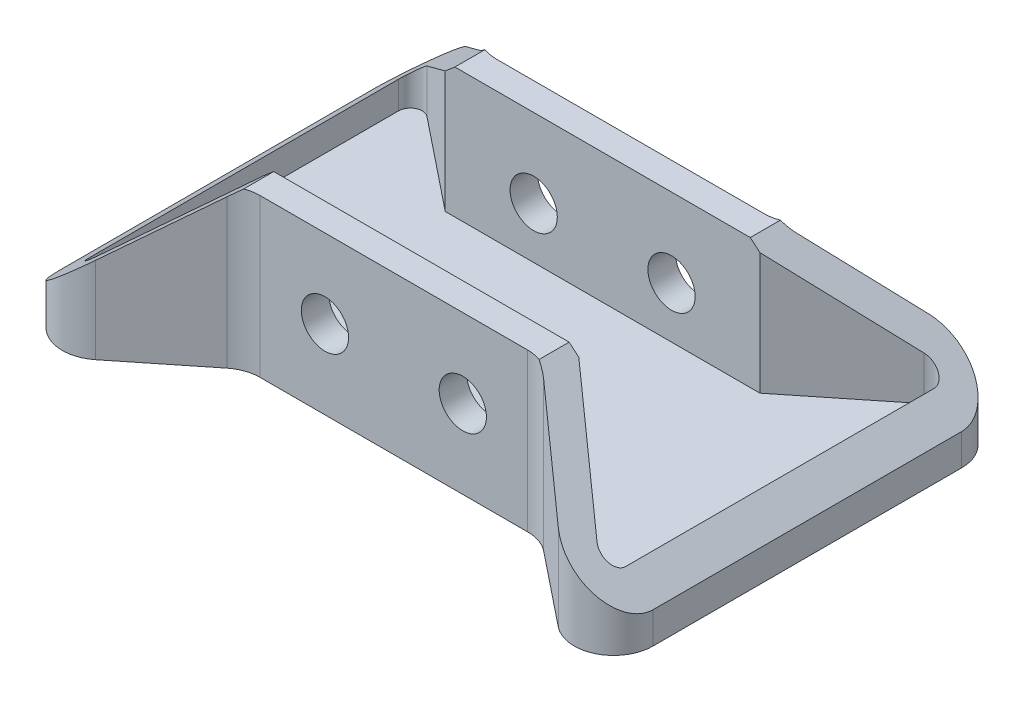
ISO-10303-21;
HEADER;
FILE_DESCRIPTION(('STEP AP214'),'2;1');
FILE_NAME('part.step','',(''),(''),'','','');
FILE_SCHEMA(('AUTOMOTIVE_DESIGN { 1 0 10303 214 1 1 1 1 }'));
ENDSEC;
DATA;
#1=APPLICATION_CONTEXT('core data for automotive mechanical design processes');
#2=APPLICATION_PROTOCOL_DEFINITION('international standard','automotive_design',2000,#1);
#3=PRODUCT_CONTEXT('',#1,'mechanical');
#4=PRODUCT('Part','Part','',(#3));
#5=PRODUCT_RELATED_PRODUCT_CATEGORY('part','',(#4));
#6=PRODUCT_DEFINITION_FORMATION('','',#4);
#7=PRODUCT_DEFINITION_CONTEXT('part definition',#1,'design');
#8=PRODUCT_DEFINITION('design','',#6,#7);
#9=PRODUCT_DEFINITION_SHAPE('','',#8);
#10=(LENGTH_UNIT() NAMED_UNIT(*) SI_UNIT(.MILLI.,.METRE.));
#11=(NAMED_UNIT(*) PLANE_ANGLE_UNIT() SI_UNIT($,.RADIAN.));
#12=(NAMED_UNIT(*) SI_UNIT($,.STERADIAN.) SOLID_ANGLE_UNIT());
#13=UNCERTAINTY_MEASURE_WITH_UNIT(LENGTH_MEASURE(1.E-05),#10,'distance_accuracy_value','');
#14=(GEOMETRIC_REPRESENTATION_CONTEXT(3) GLOBAL_UNCERTAINTY_ASSIGNED_CONTEXT((#13)) GLOBAL_UNIT_ASSIGNED_CONTEXT((#10,
#11,#12)) REPRESENTATION_CONTEXT('',''));
#15=CARTESIAN_POINT('',(0.,0.,0.));
#16=DIRECTION('',(0.,0.,1.));
#17=DIRECTION('',(1.,0.,0.));
#18=AXIS2_PLACEMENT_3D('',#15,#16,#17);
#19=CARTESIAN_POINT('',(65.,40.,-39.1937515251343));
#20=DIRECTION('',(0.,-1.,0.));
#21=DIRECTION('',(0.,0.,-1.));
#22=AXIS2_PLACEMENT_3D('',#19,#20,#21);
#23=PLANE('',#22);
#24=DIRECTION('',(-1.,0.,0.));
#25=VECTOR('',#24,1.);
#26=CARTESIAN_POINT('',(65.,40.,-23.));
#27=LINE('',#26,#25);
#28=CARTESIAN_POINT('',(37.5,40.,-23.));
#29=VERTEX_POINT('',#28);
#30=CARTESIAN_POINT('',(-37.5,40.,-23.));
#31=VERTEX_POINT('',#30);
#32=EDGE_CURVE('E288',#29,#31,#27,.T.);
#33=ORIENTED_EDGE('',*,*,#32,.F.);
#34=DIRECTION('',(0.,0.,1.));
#35=VECTOR('',#34,1.);
#36=CARTESIAN_POINT('',(37.5,40.,-39.1937515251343));
#37=LINE('',#36,#35);
#38=CARTESIAN_POINT('',(37.5,40.,-30.6354250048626));
#39=VERTEX_POINT('',#38);
#40=EDGE_CURVE('E448',#39,#29,#37,.T.);
#41=ORIENTED_EDGE('',*,*,#40,.F.);
#42=CARTESIAN_POINT('',(33.9921894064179,40.,-40.));
#43=DIRECTION('',(0.,-1.,0.));
#44=DIRECTION('',(0.,0.,-1.));
#45=AXIS2_PLACEMENT_3D('',#42,#43,#44);
#46=CIRCLE('',#45,10.);
#47=CARTESIAN_POINT('',(33.9921894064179,40.,-30.));
#48=VERTEX_POINT('',#47);
#49=EDGE_CURVE('E495',#39,#48,#46,.T.);
#50=ORIENTED_EDGE('',*,*,#49,.T.);
#51=DIRECTION('',(-1.,0.,0.));
#52=VECTOR('',#51,1.);
#53=CARTESIAN_POINT('',(-37.4999999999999,40.,-30.));
#54=LINE('',#53,#52);
#55=CARTESIAN_POINT('',(-33.9921894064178,40.,-30.));
#56=VERTEX_POINT('',#55);
#57=EDGE_CURVE('E391',#48,#56,#54,.T.);
#58=ORIENTED_EDGE('',*,*,#57,.T.);
#59=CARTESIAN_POINT('',(-33.9921894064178,40.,-40.));
#60=DIRECTION('',(0.,-1.,0.));
#61=DIRECTION('',(0.,0.,-1.));
#62=AXIS2_PLACEMENT_3D('',#59,#60,#61);
#63=CIRCLE('',#62,10.);
#64=CARTESIAN_POINT('',(-37.5,40.,-30.6354250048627));
#65=VERTEX_POINT('',#64);
#66=EDGE_CURVE('E485',#56,#65,#63,.T.);
#67=ORIENTED_EDGE('',*,*,#66,.T.);
#68=DIRECTION('',(0.,0.,-1.));
#69=VECTOR('',#68,1.);
#70=CARTESIAN_POINT('',(-37.5,40.,267.242045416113));
#71=LINE('',#70,#69);
#72=EDGE_CURVE('E362',#31,#65,#71,.T.);
#73=ORIENTED_EDGE('',*,*,#72,.F.);
#74=EDGE_LOOP('',(#33,#41,#50,#58,#67,#73));
#75=FACE_BOUND('',#74,.T.);
#76=ADVANCED_FACE('F37',(#75),#23,.F.);
#77=DIRECTION('',(1.,0.,0.));
#78=VECTOR('',#77,1.);
#79=CARTESIAN_POINT('',(65.,40.,23.));
#80=LINE('',#79,#78);
#81=CARTESIAN_POINT('',(-37.5,40.,23.));
#82=VERTEX_POINT('',#81);
#83=CARTESIAN_POINT('',(37.5,40.,23.));
#84=VERTEX_POINT('',#83);
#85=EDGE_CURVE('E291',#82,#84,#80,.T.);
#86=ORIENTED_EDGE('',*,*,#85,.F.);
#87=CARTESIAN_POINT('',(-37.5,40.,30.6354250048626));
#88=VERTEX_POINT('',#87);
#89=EDGE_CURVE('E51',#88,#82,#71,.T.);
#90=ORIENTED_EDGE('',*,*,#89,.F.);
#91=CARTESIAN_POINT('',(-33.9921894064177,40.,40.));
#92=DIRECTION('',(0.,-1.,0.));
#93=DIRECTION('',(0.,0.,-1.));
#94=AXIS2_PLACEMENT_3D('',#91,#92,#93);
#95=CIRCLE('',#94,10.);
#96=CARTESIAN_POINT('',(-33.9921894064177,40.,30.));
#97=VERTEX_POINT('',#96);
#98=EDGE_CURVE('E11',#88,#97,#95,.T.);
#99=ORIENTED_EDGE('',*,*,#98,.T.);
#100=DIRECTION('',(1.,0.,0.));
#101=VECTOR('',#100,1.);
#102=CARTESIAN_POINT('',(-37.4999999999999,40.,30.));
#103=LINE('',#102,#101);
#104=CARTESIAN_POINT('',(33.9921894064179,40.,30.));
#105=VERTEX_POINT('',#104);
#106=EDGE_CURVE('E394',#97,#105,#103,.T.);
#107=ORIENTED_EDGE('',*,*,#106,.T.);
#108=CARTESIAN_POINT('',(33.9921894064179,40.,40.));
#109=DIRECTION('',(0.,-1.,0.));
#110=DIRECTION('',(0.,0.,-1.));
#111=AXIS2_PLACEMENT_3D('',#108,#109,#110);
#112=CIRCLE('',#111,10.);
#113=CARTESIAN_POINT('',(37.5,40.,30.6354250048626));
#114=VERTEX_POINT('',#113);
#115=EDGE_CURVE('E499',#105,#114,#112,.T.);
#116=ORIENTED_EDGE('',*,*,#115,.T.);
#117=EDGE_CURVE('E59',#84,#114,#37,.T.);
#118=ORIENTED_EDGE('',*,*,#117,.F.);
#119=EDGE_LOOP('',(#86,#90,#99,#107,#116,#118));
#120=FACE_BOUND('',#119,.T.);
#121=ADVANCED_FACE('F515',(#120),#23,.F.);
#122=CARTESIAN_POINT('',(37.5,40.,267.242045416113));
#123=DIRECTION('',(0.649119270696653,0.76068664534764,0.));
#124=DIRECTION('',(-0.76068664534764,0.649119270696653,0.));
#125=AXIS2_PLACEMENT_3D('',#122,#123,#124);
#126=PLANE('',#125);
#127=DIRECTION('',(0.649819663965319,-0.554512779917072,0.519855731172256));
#128=VECTOR('',#127,1.);
#129=CARTESIAN_POINT('',(40.5282773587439,37.4158699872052,23.4582479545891));
#130=LINE('',#129,#128);
#131=CARTESIAN_POINT('',(39.9554674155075,37.9046678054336,23.));
#132=VERTEX_POINT('',#131);
#133=CARTESIAN_POINT('',(63.1259148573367,18.1325526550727,41.5363579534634));
#134=VERTEX_POINT('',#133);
#135=EDGE_CURVE('E253',#132,#134,#130,.T.);
#136=ORIENTED_EDGE('',*,*,#135,.F.);
#137=DIRECTION('',(-0.76068664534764,0.649119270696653,0.));
#138=VECTOR('',#137,1.);
#139=CARTESIAN_POINT('',(37.5,40.,23.));
#140=LINE('',#139,#138);
#141=EDGE_CURVE('E358',#132,#84,#140,.T.);
#142=ORIENTED_EDGE('',*,*,#141,.T.);
#143=ORIENTED_EDGE('',*,*,#117,.T.);
#144=CARTESIAN_POINT('',(33.9921894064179,42.9933317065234,40.));
#145=DIRECTION('',(0.649119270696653,0.76068664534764,0.));
#146=DIRECTION('',(-0.76068664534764,0.649119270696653,0.));
#147=AXIS2_PLACEMENT_3D('',#144,#145,#146);
#148=ELLIPSE('',#147,13.1460175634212,10.);
#149=CARTESIAN_POINT('',(40.2391398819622,37.662600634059,32.1913119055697));
#150=VERTEX_POINT('',#149);
#151=EDGE_CURVE('E501',#114,#150,#148,.F.);
#152=ORIENTED_EDGE('',*,*,#151,.T.);
#153=DIRECTION('',(0.649819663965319,-0.554512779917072,0.519855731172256));
#154=VECTOR('',#153,1.);
#155=CARTESIAN_POINT('',(37.5,40.,30.));
#156=LINE('',#155,#154);
#157=CARTESIAN_POINT('',(58.7530495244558,21.8640644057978,47.0024396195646));
#158=VERTEX_POINT('',#157);
#159=EDGE_CURVE('E388',#150,#158,#156,.T.);
#160=ORIENTED_EDGE('',*,*,#159,.T.);
#161=CARTESIAN_POINT('',(65.,16.5333333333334,39.1937515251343));
#162=DIRECTION('',(0.649119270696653,0.76068664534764,0.));
#163=DIRECTION('',(0.76068664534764,-0.649119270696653,0.));
#164=AXIS2_PLACEMENT_3D('',#161,#162,#163);
#165=ELLIPSE('',#164,13.1460175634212,10.);
#166=CARTESIAN_POINT('',(75.,8.00000000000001,39.1937515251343));
#167=VERTEX_POINT('',#166);
#168=EDGE_CURVE('E385',#158,#167,#165,.T.);
#169=ORIENTED_EDGE('',*,*,#168,.T.);
#170=DIRECTION('',(0.,0.,-1.));
#171=VECTOR('',#170,1.);
#172=CARTESIAN_POINT('',(75.,8.,267.242045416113));
#173=LINE('',#172,#171);
#174=CARTESIAN_POINT('',(75.,8.00000000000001,-39.1937515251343));
#175=VERTEX_POINT('',#174);
#176=EDGE_CURVE('E376',#167,#175,#173,.T.);
#177=ORIENTED_EDGE('',*,*,#176,.T.);
#178=CARTESIAN_POINT('',(65.,16.5333333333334,-39.1937515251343));
#179=DIRECTION('',(0.649119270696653,0.76068664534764,0.));
#180=DIRECTION('',(0.76068664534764,-0.649119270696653,0.));
#181=AXIS2_PLACEMENT_3D('',#178,#179,#180);
#182=ELLIPSE('',#181,13.1460175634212,10.);
#183=CARTESIAN_POINT('',(58.7530495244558,21.8640644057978,-47.0024396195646));
#184=VERTEX_POINT('',#183);
#185=EDGE_CURVE('E382',#175,#184,#182,.T.);
#186=ORIENTED_EDGE('',*,*,#185,.T.);
#187=DIRECTION('',(-0.649819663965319,0.554512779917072,0.519855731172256));
#188=VECTOR('',#187,1.);
#189=CARTESIAN_POINT('',(37.5,40.,-30.));
#190=LINE('',#189,#188);
#191=CARTESIAN_POINT('',(40.2391398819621,37.662600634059,-32.1913119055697));
#192=VERTEX_POINT('',#191);
#193=EDGE_CURVE('E379',#184,#192,#190,.T.);
#194=ORIENTED_EDGE('',*,*,#193,.T.);
#195=CARTESIAN_POINT('',(33.9921894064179,42.9933317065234,-40.));
#196=DIRECTION('',(0.649119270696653,0.76068664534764,0.));
#197=DIRECTION('',(-0.76068664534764,0.649119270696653,0.));
#198=AXIS2_PLACEMENT_3D('',#195,#196,#197);
#199=ELLIPSE('',#198,13.1460175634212,10.);
#200=EDGE_CURVE('E492',#192,#39,#199,.F.);
#201=ORIENTED_EDGE('',*,*,#200,.T.);
#202=ORIENTED_EDGE('',*,*,#40,.T.);
#203=DIRECTION('',(-0.76068664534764,0.649119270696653,0.));
#204=VECTOR('',#203,1.);
#205=CARTESIAN_POINT('',(-5.89831293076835,77.0332270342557,-23.));
#206=LINE('',#205,#204);
#207=CARTESIAN_POINT('',(39.9554674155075,37.9046678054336,-23.));
#208=VERTEX_POINT('',#207);
#209=EDGE_CURVE('E352',#208,#29,#206,.T.);
#210=ORIENTED_EDGE('',*,*,#209,.F.);
#211=DIRECTION('',(-0.649819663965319,0.554512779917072,0.519855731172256));
#212=VECTOR('',#211,1.);
#213=CARTESIAN_POINT('',(40.5282773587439,37.4158699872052,-23.4582479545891));
#214=LINE('',#213,#212);
#215=CARTESIAN_POINT('',(63.1259148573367,18.1325526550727,-41.5363579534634));
#216=VERTEX_POINT('',#215);
#217=EDGE_CURVE('E331',#216,#208,#214,.T.);
#218=ORIENTED_EDGE('',*,*,#217,.F.);
#219=CARTESIAN_POINT('',(65.,16.5333333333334,-39.1937515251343));
#220=DIRECTION('',(0.649119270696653,0.76068664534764,0.));
#221=DIRECTION('',(0.76068664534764,-0.649119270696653,0.));
#222=AXIS2_PLACEMENT_3D('',#219,#220,#221);
#223=ELLIPSE('',#222,3.94380526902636,3.00000000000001);
#224=CARTESIAN_POINT('',(68.,13.9733333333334,-39.1937515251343));
#225=VERTEX_POINT('',#224);
#226=EDGE_CURVE('E327',#225,#216,#223,.T.);
#227=ORIENTED_EDGE('',*,*,#226,.F.);
#228=DIRECTION('',(0.,0.,-1.));
#229=VECTOR('',#228,1.);
#230=CARTESIAN_POINT('',(68.,13.9733333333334,-39.1937515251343));
#231=LINE('',#230,#229);
#232=CARTESIAN_POINT('',(68.,13.9733333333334,39.1937515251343));
#233=VERTEX_POINT('',#232);
#234=EDGE_CURVE('E328',#233,#225,#231,.T.);
#235=ORIENTED_EDGE('',*,*,#234,.F.);
#236=CARTESIAN_POINT('',(65.,16.5333333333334,39.1937515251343));
#237=DIRECTION('',(0.649119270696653,0.76068664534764,0.));
#238=DIRECTION('',(0.76068664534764,-0.649119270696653,0.));
#239=AXIS2_PLACEMENT_3D('',#236,#237,#238);
#240=ELLIPSE('',#239,3.94380526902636,3.00000000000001);
#241=EDGE_CURVE('E325',#134,#233,#240,.T.);
#242=ORIENTED_EDGE('',*,*,#241,.F.);
#243=EDGE_LOOP('',(#136,#142,#143,#152,#160,#169,#177,#186,#194,#201,#202,#210,#218,#227,#235,#242));
#244=FACE_BOUND('',#243,.T.);
#245=ADVANCED_FACE('F528',(#244),#126,.T.);
#246=CARTESIAN_POINT('',(-37.5,40.,267.242045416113));
#247=DIRECTION('',(0.649119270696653,-0.76068664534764,0.));
#248=DIRECTION('',(0.76068664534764,0.649119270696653,0.));
#249=AXIS2_PLACEMENT_3D('',#246,#247,#248);
#250=PLANE('',#249);
#251=DIRECTION('',(0.76068664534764,0.649119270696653,0.));
#252=VECTOR('',#251,1.);
#253=CARTESIAN_POINT('',(-37.5,40.,23.));
#254=LINE('',#253,#252);
#255=CARTESIAN_POINT('',(-39.9554674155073,37.9046678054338,23.));
#256=VERTEX_POINT('',#255);
#257=EDGE_CURVE('E360',#256,#82,#254,.T.);
#258=ORIENTED_EDGE('',*,*,#257,.F.);
#259=DIRECTION('',(-0.649819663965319,-0.554512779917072,0.519855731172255));
#260=VECTOR('',#259,1.);
#261=CARTESIAN_POINT('',(-40.5282773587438,37.4158699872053,23.4582479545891));
#262=LINE('',#261,#260);
#263=CARTESIAN_POINT('',(-63.1259148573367,18.1325526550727,41.5363579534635));
#264=VERTEX_POINT('',#263);
#265=EDGE_CURVE('E298',#256,#264,#262,.T.);
#266=ORIENTED_EDGE('',*,*,#265,.T.);
#267=CARTESIAN_POINT('',(-65.,16.5333333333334,39.1937515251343));
#268=DIRECTION('',(0.649119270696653,-0.76068664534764,0.));
#269=DIRECTION('',(-0.76068664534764,-0.649119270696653,0.));
#270=AXIS2_PLACEMENT_3D('',#267,#268,#269);
#271=ELLIPSE('',#270,3.94380526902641,3.00000000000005);
#272=CARTESIAN_POINT('',(-68.,13.9733333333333,39.1937515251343));
#273=VERTEX_POINT('',#272);
#274=EDGE_CURVE('E343',#264,#273,#271,.T.);
#275=ORIENTED_EDGE('',*,*,#274,.T.);
#276=DIRECTION('',(0.,0.,-1.));
#277=VECTOR('',#276,1.);
#278=CARTESIAN_POINT('',(-68.,13.9733333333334,-39.1937515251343));
#279=LINE('',#278,#277);
#280=CARTESIAN_POINT('',(-68.,13.9733333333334,-39.1937515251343));
#281=VERTEX_POINT('',#280);
#282=EDGE_CURVE('E344',#273,#281,#279,.T.);
#283=ORIENTED_EDGE('',*,*,#282,.T.);
#284=CARTESIAN_POINT('',(-65.,16.5333333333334,-39.1937515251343));
#285=DIRECTION('',(0.649119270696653,-0.76068664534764,0.));
#286=DIRECTION('',(-0.76068664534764,-0.649119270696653,0.));
#287=AXIS2_PLACEMENT_3D('',#284,#285,#286);
#288=ELLIPSE('',#287,3.94380526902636,3.00000000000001);
#289=CARTESIAN_POINT('',(-63.1259148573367,18.1325526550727,-41.5363579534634));
#290=VERTEX_POINT('',#289);
#291=EDGE_CURVE('E340',#281,#290,#288,.T.);
#292=ORIENTED_EDGE('',*,*,#291,.T.);
#293=DIRECTION('',(0.64981966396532,0.554512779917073,0.519855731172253));
#294=VECTOR('',#293,1.);
#295=CARTESIAN_POINT('',(-40.5282773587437,37.4158699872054,-23.4582479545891));
#296=LINE('',#295,#294);
#297=CARTESIAN_POINT('',(-39.9554674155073,37.9046678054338,-23.));
#298=VERTEX_POINT('',#297);
#299=EDGE_CURVE('E332',#290,#298,#296,.T.);
#300=ORIENTED_EDGE('',*,*,#299,.T.);
#301=DIRECTION('',(0.76068664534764,0.649119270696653,0.));
#302=VECTOR('',#301,1.);
#303=CARTESIAN_POINT('',(-37.4999999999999,40.0000000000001,-23.));
#304=LINE('',#303,#302);
#305=EDGE_CURVE('E355',#298,#31,#304,.T.);
#306=ORIENTED_EDGE('',*,*,#305,.T.);
#307=ORIENTED_EDGE('',*,*,#72,.T.);
#308=CARTESIAN_POINT('',(-33.9921894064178,42.9933317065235,-40.));
#309=DIRECTION('',(0.649119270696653,-0.76068664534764,0.));
#310=DIRECTION('',(0.76068664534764,0.649119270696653,0.));
#311=AXIS2_PLACEMENT_3D('',#308,#309,#310);
#312=ELLIPSE('',#311,13.1460175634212,10.);
#313=CARTESIAN_POINT('',(-40.239139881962,37.6626006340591,-32.1913119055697));
#314=VERTEX_POINT('',#313);
#315=EDGE_CURVE('E488',#65,#314,#312,.T.);
#316=ORIENTED_EDGE('',*,*,#315,.T.);
#317=DIRECTION('',(0.64981966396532,0.554512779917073,0.519855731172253));
#318=VECTOR('',#317,1.);
#319=CARTESIAN_POINT('',(-37.4999999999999,40.0000000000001,-30.));
#320=LINE('',#319,#318);
#321=CARTESIAN_POINT('',(-58.7530495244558,21.8640644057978,-47.0024396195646));
#322=VERTEX_POINT('',#321);
#323=EDGE_CURVE('E373',#322,#314,#320,.T.);
#324=ORIENTED_EDGE('',*,*,#323,.F.);
#325=CARTESIAN_POINT('',(-65.,16.5333333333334,-39.1937515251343));
#326=DIRECTION('',(0.649119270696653,-0.76068664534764,0.));
#327=DIRECTION('',(-0.76068664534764,-0.649119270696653,0.));
#328=AXIS2_PLACEMENT_3D('',#325,#326,#327);
#329=ELLIPSE('',#328,13.1460175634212,10.);
#330=CARTESIAN_POINT('',(-75.,8.,-39.1937515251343));
#331=VERTEX_POINT('',#330);
#332=EDGE_CURVE('E370',#331,#322,#329,.T.);
#333=ORIENTED_EDGE('',*,*,#332,.F.);
#334=DIRECTION('',(0.,0.,-1.));
#335=VECTOR('',#334,1.);
#336=CARTESIAN_POINT('',(-75.,8.,267.242045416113));
#337=LINE('',#336,#335);
#338=CARTESIAN_POINT('',(-75.0000000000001,7.99999999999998,39.1937515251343));
#339=VERTEX_POINT('',#338);
#340=EDGE_CURVE('E363',#339,#331,#337,.T.);
#341=ORIENTED_EDGE('',*,*,#340,.F.);
#342=CARTESIAN_POINT('',(-65.,16.5333333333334,39.1937515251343));
#343=DIRECTION('',(0.649119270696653,-0.76068664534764,0.));
#344=DIRECTION('',(-0.76068664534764,-0.649119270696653,0.));
#345=AXIS2_PLACEMENT_3D('',#342,#343,#344);
#346=ELLIPSE('',#345,13.1460175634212,10.);
#347=CARTESIAN_POINT('',(-58.7530495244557,21.8640644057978,47.0024396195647));
#348=VERTEX_POINT('',#347);
#349=EDGE_CURVE('E366',#348,#339,#346,.T.);
#350=ORIENTED_EDGE('',*,*,#349,.F.);
#351=DIRECTION('',(-0.649819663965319,-0.554512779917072,0.519855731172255));
#352=VECTOR('',#351,1.);
#353=CARTESIAN_POINT('',(-37.4999999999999,40.0000000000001,30.));
#354=LINE('',#353,#352);
#355=CARTESIAN_POINT('',(-40.239139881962,37.6626006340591,32.1913119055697));
#356=VERTEX_POINT('',#355);
#357=EDGE_CURVE('E451',#356,#348,#354,.T.);
#358=ORIENTED_EDGE('',*,*,#357,.F.);
#359=CARTESIAN_POINT('',(-33.9921894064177,42.9933317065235,40.));
#360=DIRECTION('',(0.649119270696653,-0.76068664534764,0.));
#361=DIRECTION('',(0.76068664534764,0.649119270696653,0.));
#362=AXIS2_PLACEMENT_3D('',#359,#360,#361);
#363=ELLIPSE('',#362,13.1460175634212,10.);
#364=EDGE_CURVE('E45',#356,#88,#363,.T.);
#365=ORIENTED_EDGE('',*,*,#364,.T.);
#366=ORIENTED_EDGE('',*,*,#89,.T.);
#367=EDGE_LOOP('',(#258,#266,#275,#283,#292,#300,#306,#307,#316,#324,#333,#341,#350,#358,#365,#366));
#368=FACE_BOUND('',#367,.T.);
#369=ADVANCED_FACE('F509',(#368),#250,.F.);
#370=CARTESIAN_POINT('',(37.5,40.,30.));
#371=DIRECTION('',(0.624695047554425,0.,-0.78086880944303));
#372=DIRECTION('',(-0.78086880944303,0.,-0.624695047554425));
#373=AXIS2_PLACEMENT_3D('',#370,#371,#372);
#374=PLANE('',#373);
#375=ORIENTED_EDGE('',*,*,#159,.F.);
#376=DIRECTION('',(0.,-1.,0.));
#377=VECTOR('',#376,1.);
#378=CARTESIAN_POINT('',(40.2391398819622,0.,32.1913119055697));
#379=LINE('',#378,#377);
#380=CARTESIAN_POINT('',(40.2391398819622,0.,32.1913119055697));
#381=VERTEX_POINT('',#380);
#382=EDGE_CURVE('E473',#150,#381,#379,.T.);
#383=ORIENTED_EDGE('',*,*,#382,.T.);
#384=DIRECTION('',(0.78086880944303,0.,0.624695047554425));
#385=VECTOR('',#384,1.);
#386=CARTESIAN_POINT('',(37.5,0.,30.));
#387=LINE('',#386,#385);
#388=CARTESIAN_POINT('',(58.7530495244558,0.,47.0024396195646));
#389=VERTEX_POINT('',#388);
#390=EDGE_CURVE('E418',#381,#389,#387,.T.);
#391=ORIENTED_EDGE('',*,*,#390,.T.);
#392=DIRECTION('',(0.,-1.,0.));
#393=VECTOR('',#392,1.);
#394=CARTESIAN_POINT('',(58.7530495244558,40.,47.0024396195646));
#395=LINE('',#394,#393);
#396=EDGE_CURVE('E436',#158,#389,#395,.T.);
#397=ORIENTED_EDGE('',*,*,#396,.F.);
#398=EDGE_LOOP('',(#375,#383,#391,#397));
#399=FACE_BOUND('',#398,.T.);
#400=ADVANCED_FACE('F633',(#399),#374,.F.);
#401=CARTESIAN_POINT('',(65.,40.,39.1937515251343));
#402=DIRECTION('',(0.,-1.,0.));
#403=DIRECTION('',(0.,0.,-1.));
#404=AXIS2_PLACEMENT_3D('',#401,#402,#403);
#405=CYLINDRICAL_SURFACE('',#404,10.);
#406=ORIENTED_EDGE('',*,*,#168,.F.);
#407=ORIENTED_EDGE('',*,*,#396,.T.);
#408=CARTESIAN_POINT('',(65.,0.,39.1937515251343));
#409=DIRECTION('',(0.,1.,0.));
#410=DIRECTION('',(0.,0.,1.));
#411=AXIS2_PLACEMENT_3D('',#408,#409,#410);
#412=CIRCLE('',#411,10.);
#413=CARTESIAN_POINT('',(75.,0.,39.1937515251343));
#414=VERTEX_POINT('',#413);
#415=EDGE_CURVE('E420',#389,#414,#412,.T.);
#416=ORIENTED_EDGE('',*,*,#415,.T.);
#417=DIRECTION('',(0.,-1.,0.));
#418=VECTOR('',#417,1.);
#419=CARTESIAN_POINT('',(75.,40.,39.1937515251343));
#420=LINE('',#419,#418);
#421=EDGE_CURVE('E434',#167,#414,#420,.T.);
#422=ORIENTED_EDGE('',*,*,#421,.F.);
#423=EDGE_LOOP('',(#406,#407,#416,#422));
#424=FACE_BOUND('',#423,.T.);
#425=ADVANCED_FACE('F629',(#424),#405,.T.);
#426=CARTESIAN_POINT('',(75.,40.,-39.1937515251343));
#427=DIRECTION('',(-1.,0.,0.));
#428=DIRECTION('',(0.,0.,1.));
#429=AXIS2_PLACEMENT_3D('',#426,#427,#428);
#430=PLANE('',#429);
#431=ORIENTED_EDGE('',*,*,#176,.F.);
#432=ORIENTED_EDGE('',*,*,#421,.T.);
#433=DIRECTION('',(0.,0.,-1.));
#434=VECTOR('',#433,1.);
#435=CARTESIAN_POINT('',(75.,0.,-39.1937515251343));
#436=LINE('',#435,#434);
#437=CARTESIAN_POINT('',(75.,0.,-39.1937515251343));
#438=VERTEX_POINT('',#437);
#439=EDGE_CURVE('E423',#414,#438,#436,.T.);
#440=ORIENTED_EDGE('',*,*,#439,.T.);
#441=DIRECTION('',(0.,-1.,0.));
#442=VECTOR('',#441,1.);
#443=CARTESIAN_POINT('',(75.,40.,-39.1937515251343));
#444=LINE('',#443,#442);
#445=EDGE_CURVE('E432',#175,#438,#444,.T.);
#446=ORIENTED_EDGE('',*,*,#445,.F.);
#447=EDGE_LOOP('',(#431,#432,#440,#446));
#448=FACE_BOUND('',#447,.T.);
#449=ADVANCED_FACE('F625',(#448),#430,.F.);
#450=CARTESIAN_POINT('',(65.,40.,-39.1937515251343));
#451=DIRECTION('',(0.,-1.,0.));
#452=DIRECTION('',(0.,0.,-1.));
#453=AXIS2_PLACEMENT_3D('',#450,#451,#452);
#454=CYLINDRICAL_SURFACE('',#453,10.);
#455=ORIENTED_EDGE('',*,*,#185,.F.);
#456=ORIENTED_EDGE('',*,*,#445,.T.);
#457=CARTESIAN_POINT('',(65.,0.,-39.1937515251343));
#458=DIRECTION('',(0.,1.,0.));
#459=DIRECTION('',(0.,0.,-1.));
#460=AXIS2_PLACEMENT_3D('',#457,#458,#459);
#461=CIRCLE('',#460,10.);
#462=CARTESIAN_POINT('',(58.7530495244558,0.,-47.0024396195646));
#463=VERTEX_POINT('',#462);
#464=EDGE_CURVE('E426',#438,#463,#461,.T.);
#465=ORIENTED_EDGE('',*,*,#464,.T.);
#466=DIRECTION('',(0.,-1.,0.));
#467=VECTOR('',#466,1.);
#468=CARTESIAN_POINT('',(58.7530495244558,40.,-47.0024396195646));
#469=LINE('',#468,#467);
#470=EDGE_CURVE('E398',#184,#463,#469,.T.);
#471=ORIENTED_EDGE('',*,*,#470,.F.);
#472=EDGE_LOOP('',(#455,#456,#465,#471));
#473=FACE_BOUND('',#472,.T.);
#474=ADVANCED_FACE('F621',(#473),#454,.T.);
#475=CARTESIAN_POINT('',(37.5,40.,-30.));
#476=DIRECTION('',(0.624695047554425,0.,0.78086880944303));
#477=DIRECTION('',(0.78086880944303,0.,-0.624695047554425));
#478=AXIS2_PLACEMENT_3D('',#475,#476,#477);
#479=PLANE('',#478);
#480=DIRECTION('',(-0.78086880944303,0.,0.624695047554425));
#481=VECTOR('',#480,1.);
#482=CARTESIAN_POINT('',(37.5,0.,-30.));
#483=LINE('',#482,#481);
#484=CARTESIAN_POINT('',(40.2391398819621,0.,-32.1913119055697));
#485=VERTEX_POINT('',#484);
#486=EDGE_CURVE('E395',#463,#485,#483,.T.);
#487=ORIENTED_EDGE('',*,*,#486,.T.);
#488=DIRECTION('',(0.,-1.,0.));
#489=VECTOR('',#488,1.);
#490=CARTESIAN_POINT('',(40.2391398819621,40.,-32.1913119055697));
#491=LINE('',#490,#489);
#492=EDGE_CURVE('E471',#485,#192,#491,.F.);
#493=ORIENTED_EDGE('',*,*,#492,.T.);
#494=ORIENTED_EDGE('',*,*,#193,.F.);
#495=ORIENTED_EDGE('',*,*,#470,.T.);
#496=EDGE_LOOP('',(#487,#493,#494,#495));
#497=FACE_BOUND('',#496,.T.);
#498=ADVANCED_FACE('F617',(#497),#479,.F.);
#499=CARTESIAN_POINT('',(-37.4999999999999,40.,-30.));
#500=DIRECTION('',(0.,0.,1.));
#501=DIRECTION('',(1.,0.,0.));
#502=AXIS2_PLACEMENT_3D('',#499,#500,#501);
#503=PLANE('',#502);
#504=CARTESIAN_POINT('',(17.5,20.,-30.));
#505=DIRECTION('',(0.,0.,1.));
#506=DIRECTION('',(1.,0.,0.));
#507=AXIS2_PLACEMENT_3D('',#504,#505,#506);
#508=CIRCLE('',#507,6.);
#509=CARTESIAN_POINT('',(23.5,20.,-30.));
#510=VERTEX_POINT('',#509);
#511=EDGE_CURVE('E572',#510,#510,#508,.T.);
#512=ORIENTED_EDGE('',*,*,#511,.T.);
#513=EDGE_LOOP('',(#512));
#514=FACE_BOUND('',#513,.T.);
#515=CARTESIAN_POINT('',(-17.5,20.,-30.));
#516=DIRECTION('',(0.,0.,1.));
#517=DIRECTION('',(1.,0.,0.));
#518=AXIS2_PLACEMENT_3D('',#515,#516,#517);
#519=CIRCLE('',#518,6.);
#520=CARTESIAN_POINT('',(-11.5,20.,-30.));
#521=VERTEX_POINT('',#520);
#522=EDGE_CURVE('E347',#521,#521,#519,.T.);
#523=ORIENTED_EDGE('',*,*,#522,.T.);
#524=EDGE_LOOP('',(#523));
#525=FACE_BOUND('',#524,.T.);
#526=DIRECTION('',(-1.,0.,0.));
#527=VECTOR('',#526,1.);
#528=CARTESIAN_POINT('',(-37.4999999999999,0.,-30.));
#529=LINE('',#528,#527);
#530=CARTESIAN_POINT('',(33.9921894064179,0.,-30.));
#531=VERTEX_POINT('',#530);
#532=CARTESIAN_POINT('',(-33.9921894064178,0.,-30.));
#533=VERTEX_POINT('',#532);
#534=EDGE_CURVE('E390',#531,#533,#529,.T.);
#535=ORIENTED_EDGE('',*,*,#534,.T.);
#536=DIRECTION('',(0.,-1.,0.));
#537=VECTOR('',#536,1.);
#538=CARTESIAN_POINT('',(-33.9921894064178,40.,-30.));
#539=LINE('',#538,#537);
#540=EDGE_CURVE('E469',#533,#56,#539,.F.);
#541=ORIENTED_EDGE('',*,*,#540,.T.);
#542=ORIENTED_EDGE('',*,*,#57,.F.);
#543=DIRECTION('',(0.,-1.,0.));
#544=VECTOR('',#543,1.);
#545=CARTESIAN_POINT('',(33.9921894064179,0.,-30.));
#546=LINE('',#545,#544);
#547=EDGE_CURVE('E466',#48,#531,#546,.T.);
#548=ORIENTED_EDGE('',*,*,#547,.T.);
#549=EDGE_LOOP('',(#535,#541,#542,#548));
#550=FACE_BOUND('',#549,.T.);
#551=ADVANCED_FACE('F620',(#514,#525,#550),#503,.F.);
#552=CARTESIAN_POINT('',(-37.4999999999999,40.,-30.));
#553=DIRECTION('',(-0.624695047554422,0.,0.780868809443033));
#554=DIRECTION('',(0.780868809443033,0.,0.624695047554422));
#555=AXIS2_PLACEMENT_3D('',#552,#553,#554);
#556=PLANE('',#555);
#557=ORIENTED_EDGE('',*,*,#323,.T.);
#558=DIRECTION('',(0.,-1.,0.));
#559=VECTOR('',#558,1.);
#560=CARTESIAN_POINT('',(-40.239139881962,0.,-32.1913119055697));
#561=LINE('',#560,#559);
#562=CARTESIAN_POINT('',(-40.239139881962,0.,-32.1913119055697));
#563=VERTEX_POINT('',#562);
#564=EDGE_CURVE('E453',#314,#563,#561,.T.);
#565=ORIENTED_EDGE('',*,*,#564,.T.);
#566=DIRECTION('',(-0.780868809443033,0.,-0.624695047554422));
#567=VECTOR('',#566,1.);
#568=CARTESIAN_POINT('',(-37.4999999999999,0.,-30.));
#569=LINE('',#568,#567);
#570=CARTESIAN_POINT('',(-58.7530495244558,0.,-47.0024396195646));
#571=VERTEX_POINT('',#570);
#572=EDGE_CURVE('E401',#563,#571,#569,.T.);
#573=ORIENTED_EDGE('',*,*,#572,.T.);
#574=DIRECTION('',(0.,-1.,0.));
#575=VECTOR('',#574,1.);
#576=CARTESIAN_POINT('',(-58.7530495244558,40.,-47.0024396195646));
#577=LINE('',#576,#575);
#578=EDGE_CURVE('E445',#322,#571,#577,.T.);
#579=ORIENTED_EDGE('',*,*,#578,.F.);
#580=EDGE_LOOP('',(#557,#565,#573,#579));
#581=FACE_BOUND('',#580,.T.);
#582=ADVANCED_FACE('F652',(#581),#556,.F.);
#583=CARTESIAN_POINT('',(-65.,40.,-39.1937515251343));
#584=DIRECTION('',(0.,-1.,0.));
#585=DIRECTION('',(0.,0.,-1.));
#586=AXIS2_PLACEMENT_3D('',#583,#584,#585);
#587=CYLINDRICAL_SURFACE('',#586,10.);
#588=DIRECTION('',(0.,-1.,0.));
#589=VECTOR('',#588,1.);
#590=CARTESIAN_POINT('',(-75.,40.,-39.1937515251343));
#591=LINE('',#590,#589);
#592=CARTESIAN_POINT('',(-75.,0.,-39.1937515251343));
#593=VERTEX_POINT('',#592);
#594=EDGE_CURVE('E443',#331,#593,#591,.T.);
#595=ORIENTED_EDGE('',*,*,#594,.F.);
#596=ORIENTED_EDGE('',*,*,#332,.T.);
#597=ORIENTED_EDGE('',*,*,#578,.T.);
#598=CARTESIAN_POINT('',(-65.,0.,-39.1937515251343));
#599=DIRECTION('',(0.,1.,0.));
#600=DIRECTION('',(0.,0.,1.));
#601=AXIS2_PLACEMENT_3D('',#598,#599,#600);
#602=CIRCLE('',#601,10.);
#603=EDGE_CURVE('E403',#571,#593,#602,.T.);
#604=ORIENTED_EDGE('',*,*,#603,.T.);
#605=EDGE_LOOP('',(#595,#596,#597,#604));
#606=FACE_BOUND('',#605,.T.);
#607=ADVANCED_FACE('F648',(#606),#587,.T.);
#608=CARTESIAN_POINT('',(-75.,40.,-39.1937515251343));
#609=DIRECTION('',(1.,0.,0.));
#610=DIRECTION('',(0.,0.,-1.));
#611=AXIS2_PLACEMENT_3D('',#608,#609,#610);
#612=PLANE('',#611);
#613=DIRECTION('',(0.,-1.,0.));
#614=VECTOR('',#613,1.);
#615=CARTESIAN_POINT('',(-75.0000000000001,40.,39.1937515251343));
#616=LINE('',#615,#614);
#617=CARTESIAN_POINT('',(-75.0000000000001,0.,39.1937515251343));
#618=VERTEX_POINT('',#617);
#619=EDGE_CURVE('E441',#339,#618,#616,.T.);
#620=ORIENTED_EDGE('',*,*,#619,.F.);
#621=ORIENTED_EDGE('',*,*,#340,.T.);
#622=ORIENTED_EDGE('',*,*,#594,.T.);
#623=DIRECTION('',(0.,0.,1.));
#624=VECTOR('',#623,1.);
#625=CARTESIAN_POINT('',(-75.,0.,-39.1937515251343));
#626=LINE('',#625,#624);
#627=EDGE_CURVE('E406',#593,#618,#626,.T.);
#628=ORIENTED_EDGE('',*,*,#627,.T.);
#629=EDGE_LOOP('',(#620,#621,#622,#628));
#630=FACE_BOUND('',#629,.T.);
#631=ADVANCED_FACE('F644',(#630),#612,.F.);
#632=CARTESIAN_POINT('',(-65.,40.,39.1937515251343));
#633=DIRECTION('',(0.,-1.,0.));
#634=DIRECTION('',(0.,0.,-1.));
#635=AXIS2_PLACEMENT_3D('',#632,#633,#634);
#636=CYLINDRICAL_SURFACE('',#635,10.);
#637=DIRECTION('',(0.,-1.,0.));
#638=VECTOR('',#637,1.);
#639=CARTESIAN_POINT('',(-58.7530495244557,40.,47.0024396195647));
#640=LINE('',#639,#638);
#641=CARTESIAN_POINT('',(-58.7530495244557,0.,47.0024396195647));
#642=VERTEX_POINT('',#641);
#643=EDGE_CURVE('E439',#348,#642,#640,.T.);
#644=ORIENTED_EDGE('',*,*,#643,.F.);
#645=ORIENTED_EDGE('',*,*,#349,.T.);
#646=ORIENTED_EDGE('',*,*,#619,.T.);
#647=CARTESIAN_POINT('',(-65.,0.,39.1937515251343));
#648=DIRECTION('',(0.,1.,0.));
#649=DIRECTION('',(0.,0.,-1.));
#650=AXIS2_PLACEMENT_3D('',#647,#648,#649);
#651=CIRCLE('',#650,10.);
#652=EDGE_CURVE('E409',#618,#642,#651,.T.);
#653=ORIENTED_EDGE('',*,*,#652,.T.);
#654=EDGE_LOOP('',(#644,#645,#646,#653));
#655=FACE_BOUND('',#654,.T.);
#656=ADVANCED_FACE('F640',(#655),#636,.T.);
#657=CARTESIAN_POINT('',(-37.4999999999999,40.,30.));
#658=DIRECTION('',(-0.624695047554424,0.,-0.780868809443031));
#659=DIRECTION('',(-0.780868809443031,0.,0.624695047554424));
#660=AXIS2_PLACEMENT_3D('',#657,#658,#659);
#661=PLANE('',#660);
#662=DIRECTION('',(0.780868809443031,0.,-0.624695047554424));
#663=VECTOR('',#662,1.);
#664=CARTESIAN_POINT('',(-37.4999999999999,0.,30.));
#665=LINE('',#664,#663);
#666=CARTESIAN_POINT('',(-40.239139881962,0.,32.1913119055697));
#667=VERTEX_POINT('',#666);
#668=EDGE_CURVE('E412',#642,#667,#665,.T.);
#669=ORIENTED_EDGE('',*,*,#668,.T.);
#670=DIRECTION('',(0.,-1.,0.));
#671=VECTOR('',#670,1.);
#672=CARTESIAN_POINT('',(-40.239139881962,40.,32.1913119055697));
#673=LINE('',#672,#671);
#674=EDGE_CURVE('E481',#667,#356,#673,.F.);
#675=ORIENTED_EDGE('',*,*,#674,.T.);
#676=ORIENTED_EDGE('',*,*,#357,.T.);
#677=ORIENTED_EDGE('',*,*,#643,.T.);
#678=EDGE_LOOP('',(#669,#675,#676,#677));
#679=FACE_BOUND('',#678,.T.);
#680=ADVANCED_FACE('F585',(#679),#661,.F.);
#681=CARTESIAN_POINT('',(-37.4999999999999,40.,30.));
#682=DIRECTION('',(0.,0.,-1.));
#683=DIRECTION('',(-1.,0.,0.));
#684=AXIS2_PLACEMENT_3D('',#681,#682,#683);
#685=PLANE('',#684);
#686=CARTESIAN_POINT('',(17.5,20.,30.));
#687=DIRECTION('',(0.,0.,1.));
#688=DIRECTION('',(1.,0.,0.));
#689=AXIS2_PLACEMENT_3D('',#686,#687,#688);
#690=CIRCLE('',#689,6.);
#691=CARTESIAN_POINT('',(23.5,20.,30.));
#692=VERTEX_POINT('',#691);
#693=EDGE_CURVE('E463',#692,#692,#690,.T.);
#694=ORIENTED_EDGE('',*,*,#693,.F.);
#695=EDGE_LOOP('',(#694));
#696=FACE_BOUND('',#695,.T.);
#697=CARTESIAN_POINT('',(-17.5,20.,30.));
#698=DIRECTION('',(0.,0.,1.));
#699=DIRECTION('',(1.,0.,0.));
#700=AXIS2_PLACEMENT_3D('',#697,#698,#699);
#701=CIRCLE('',#700,6.);
#702=CARTESIAN_POINT('',(-11.5,20.,30.));
#703=VERTEX_POINT('',#702);
#704=EDGE_CURVE('E458',#703,#703,#701,.T.);
#705=ORIENTED_EDGE('',*,*,#704,.F.);
#706=EDGE_LOOP('',(#705));
#707=FACE_BOUND('',#706,.T.);
#708=DIRECTION('',(1.,0.,0.));
#709=VECTOR('',#708,1.);
#710=CARTESIAN_POINT('',(-37.4999999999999,0.,30.));
#711=LINE('',#710,#709);
#712=CARTESIAN_POINT('',(-33.9921894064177,0.,30.));
#713=VERTEX_POINT('',#712);
#714=CARTESIAN_POINT('',(33.9921894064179,0.,30.));
#715=VERTEX_POINT('',#714);
#716=EDGE_CURVE('E415',#713,#715,#711,.T.);
#717=ORIENTED_EDGE('',*,*,#716,.T.);
#718=DIRECTION('',(0.,-1.,0.));
#719=VECTOR('',#718,1.);
#720=CARTESIAN_POINT('',(33.9921894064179,40.,30.));
#721=LINE('',#720,#719);
#722=EDGE_CURVE('E479',#715,#105,#721,.F.);
#723=ORIENTED_EDGE('',*,*,#722,.T.);
#724=ORIENTED_EDGE('',*,*,#106,.F.);
#725=DIRECTION('',(0.,-1.,0.));
#726=VECTOR('',#725,1.);
#727=CARTESIAN_POINT('',(-33.9921894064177,0.,30.));
#728=LINE('',#727,#726);
#729=EDGE_CURVE('E476',#97,#713,#728,.T.);
#730=ORIENTED_EDGE('',*,*,#729,.T.);
#731=EDGE_LOOP('',(#717,#723,#724,#730));
#732=FACE_BOUND('',#731,.T.);
#733=ADVANCED_FACE('F518',(#696,#707,#732),#685,.F.);
#734=CARTESIAN_POINT('',(65.,0.,-39.1937515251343));
#735=DIRECTION('',(0.,-1.,0.));
#736=DIRECTION('',(0.,0.,-1.));
#737=AXIS2_PLACEMENT_3D('',#734,#735,#736);
#738=PLANE('',#737);
#739=ORIENTED_EDGE('',*,*,#534,.F.);
#740=CARTESIAN_POINT('',(33.9921894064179,0.,-40.));
#741=DIRECTION('',(0.,-1.,0.));
#742=DIRECTION('',(0.,0.,-1.));
#743=AXIS2_PLACEMENT_3D('',#740,#741,#742);
#744=CIRCLE('',#743,10.);
#745=EDGE_CURVE('E490',#531,#485,#744,.F.);
#746=ORIENTED_EDGE('',*,*,#745,.T.);
#747=ORIENTED_EDGE('',*,*,#486,.F.);
#748=ORIENTED_EDGE('',*,*,#464,.F.);
#749=ORIENTED_EDGE('',*,*,#439,.F.);
#750=ORIENTED_EDGE('',*,*,#415,.F.);
#751=ORIENTED_EDGE('',*,*,#390,.F.);
#752=CARTESIAN_POINT('',(33.9921894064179,0.,40.));
#753=DIRECTION('',(0.,-1.,0.));
#754=DIRECTION('',(0.,0.,-1.));
#755=AXIS2_PLACEMENT_3D('',#752,#753,#754);
#756=CIRCLE('',#755,10.);
#757=EDGE_CURVE('E497',#381,#715,#756,.F.);
#758=ORIENTED_EDGE('',*,*,#757,.T.);
#759=ORIENTED_EDGE('',*,*,#716,.F.);
#760=CARTESIAN_POINT('',(-33.9921894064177,0.,40.));
#761=DIRECTION('',(0.,-1.,0.));
#762=DIRECTION('',(0.,0.,-1.));
#763=AXIS2_PLACEMENT_3D('',#760,#761,#762);
#764=CIRCLE('',#763,10.);
#765=EDGE_CURVE('E503',#713,#667,#764,.F.);
#766=ORIENTED_EDGE('',*,*,#765,.T.);
#767=ORIENTED_EDGE('',*,*,#668,.F.);
#768=ORIENTED_EDGE('',*,*,#652,.F.);
#769=ORIENTED_EDGE('',*,*,#627,.F.);
#770=ORIENTED_EDGE('',*,*,#603,.F.);
#771=ORIENTED_EDGE('',*,*,#572,.F.);
#772=CARTESIAN_POINT('',(-33.9921894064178,0.,-40.));
#773=DIRECTION('',(0.,-1.,0.));
#774=DIRECTION('',(0.,0.,-1.));
#775=AXIS2_PLACEMENT_3D('',#772,#773,#774);
#776=CIRCLE('',#775,10.);
#777=EDGE_CURVE('E483',#563,#533,#776,.F.);
#778=ORIENTED_EDGE('',*,*,#777,.T.);
#779=EDGE_LOOP('',(#739,#746,#747,#748,#749,#750,#751,#758,#759,#766,#767,#768,#769,#770,#771,#778));
#780=FACE_BOUND('',#779,.T.);
#781=ADVANCED_FACE('F584',(#780),#738,.T.);
#782=CARTESIAN_POINT('',(41.872865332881,40.,24.5339183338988));
#783=DIRECTION('',(0.624695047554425,0.,-0.78086880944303));
#784=DIRECTION('',(-0.78086880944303,0.,-0.624695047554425));
#785=AXIS2_PLACEMENT_3D('',#782,#783,#784);
#786=PLANE('',#785);
#787=ORIENTED_EDGE('',*,*,#135,.T.);
#788=DIRECTION('',(0.,-1.,0.));
#789=VECTOR('',#788,1.);
#790=CARTESIAN_POINT('',(63.1259148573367,40.,41.5363579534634));
#791=LINE('',#790,#789);
#792=CARTESIAN_POINT('',(63.1259148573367,7.,41.5363579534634));
#793=VERTEX_POINT('',#792);
#794=EDGE_CURVE('E247',#134,#793,#791,.T.);
#795=ORIENTED_EDGE('',*,*,#794,.T.);
#796=DIRECTION('',(0.78086880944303,0.,0.624695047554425));
#797=VECTOR('',#796,1.);
#798=CARTESIAN_POINT('',(24.888108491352,7.,10.9461128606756));
#799=LINE('',#798,#797);
#800=CARTESIAN_POINT('',(39.9554674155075,7.,23.));
#801=VERTEX_POINT('',#800);
#802=EDGE_CURVE('E251',#801,#793,#799,.T.);
#803=ORIENTED_EDGE('',*,*,#802,.F.);
#804=DIRECTION('',(0.,-1.,0.));
#805=VECTOR('',#804,1.);
#806=CARTESIAN_POINT('',(39.9554674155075,40.,23.));
#807=LINE('',#806,#805);
#808=EDGE_CURVE('E258',#132,#801,#807,.T.);
#809=ORIENTED_EDGE('',*,*,#808,.F.);
#810=EDGE_LOOP('',(#787,#795,#803,#809));
#811=FACE_BOUND('',#810,.T.);
#812=ADVANCED_FACE('F249',(#811),#786,.T.);
#813=CARTESIAN_POINT('',(65.,40.,39.1937515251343));
#814=DIRECTION('',(0.,-1.,0.));
#815=DIRECTION('',(0.,0.,-1.));
#816=AXIS2_PLACEMENT_3D('',#813,#814,#815);
#817=CYLINDRICAL_SURFACE('',#816,3.00000000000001);
#818=ORIENTED_EDGE('',*,*,#241,.T.);
#819=DIRECTION('',(0.,1.,0.));
#820=VECTOR('',#819,1.);
#821=CARTESIAN_POINT('',(68.,40.,39.1937515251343));
#822=LINE('',#821,#820);
#823=CARTESIAN_POINT('',(68.,7.,39.1937515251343));
#824=VERTEX_POINT('',#823);
#825=EDGE_CURVE('E259',#233,#824,#822,.F.);
#826=ORIENTED_EDGE('',*,*,#825,.T.);
#827=CARTESIAN_POINT('',(65.,7.,39.1937515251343));
#828=DIRECTION('',(0.,-1.,0.));
#829=DIRECTION('',(0.,0.,-1.));
#830=AXIS2_PLACEMENT_3D('',#827,#828,#829);
#831=CIRCLE('',#830,3.00000000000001);
#832=EDGE_CURVE('E266',#793,#824,#831,.F.);
#833=ORIENTED_EDGE('',*,*,#832,.F.);
#834=ORIENTED_EDGE('',*,*,#794,.F.);
#835=EDGE_LOOP('',(#818,#826,#833,#834));
#836=FACE_BOUND('',#835,.T.);
#837=ADVANCED_FACE('F272',(#836),#817,.F.);
#838=CARTESIAN_POINT('',(68.,40.,-39.1937515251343));
#839=DIRECTION('',(-1.,0.,0.));
#840=DIRECTION('',(0.,0.,1.));
#841=AXIS2_PLACEMENT_3D('',#838,#839,#840);
#842=PLANE('',#841);
#843=ORIENTED_EDGE('',*,*,#234,.T.);
#844=DIRECTION('',(0.,-1.,0.));
#845=VECTOR('',#844,1.);
#846=CARTESIAN_POINT('',(68.,40.,-39.1937515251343));
#847=LINE('',#846,#845);
#848=CARTESIAN_POINT('',(68.,7.,-39.1937515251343));
#849=VERTEX_POINT('',#848);
#850=EDGE_CURVE('E278',#225,#849,#847,.T.);
#851=ORIENTED_EDGE('',*,*,#850,.T.);
#852=DIRECTION('',(0.,0.,-1.));
#853=VECTOR('',#852,1.);
#854=CARTESIAN_POINT('',(68.,7.,-39.1937515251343));
#855=LINE('',#854,#853);
#856=EDGE_CURVE('E273',#824,#849,#855,.T.);
#857=ORIENTED_EDGE('',*,*,#856,.F.);
#858=ORIENTED_EDGE('',*,*,#825,.F.);
#859=EDGE_LOOP('',(#843,#851,#857,#858));
#860=FACE_BOUND('',#859,.T.);
#861=ADVANCED_FACE('F533',(#860),#842,.T.);
#862=CARTESIAN_POINT('',(65.,40.,-39.1937515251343));
#863=DIRECTION('',(0.,-1.,0.));
#864=DIRECTION('',(0.,0.,-1.));
#865=AXIS2_PLACEMENT_3D('',#862,#863,#864);
#866=CYLINDRICAL_SURFACE('',#865,3.00000000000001);
#867=ORIENTED_EDGE('',*,*,#226,.T.);
#868=DIRECTION('',(0.,1.,0.));
#869=VECTOR('',#868,1.);
#870=CARTESIAN_POINT('',(63.1259148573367,40.,-41.5363579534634));
#871=LINE('',#870,#869);
#872=CARTESIAN_POINT('',(63.1259148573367,7.,-41.5363579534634));
#873=VERTEX_POINT('',#872);
#874=EDGE_CURVE('E281',#216,#873,#871,.F.);
#875=ORIENTED_EDGE('',*,*,#874,.T.);
#876=CARTESIAN_POINT('',(65.,7.,-39.1937515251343));
#877=DIRECTION('',(0.,-1.,0.));
#878=DIRECTION('',(0.,0.,-1.));
#879=AXIS2_PLACEMENT_3D('',#876,#877,#878);
#880=CIRCLE('',#879,3.00000000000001);
#881=EDGE_CURVE('E275',#849,#873,#880,.F.);
#882=ORIENTED_EDGE('',*,*,#881,.F.);
#883=ORIENTED_EDGE('',*,*,#850,.F.);
#884=EDGE_LOOP('',(#867,#875,#882,#883));
#885=FACE_BOUND('',#884,.T.);
#886=ADVANCED_FACE('F537',(#885),#866,.F.);
#887=CARTESIAN_POINT('',(41.872865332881,40.,-24.5339183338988));
#888=DIRECTION('',(0.624695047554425,0.,0.78086880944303));
#889=DIRECTION('',(0.78086880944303,0.,-0.624695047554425));
#890=AXIS2_PLACEMENT_3D('',#887,#888,#889);
#891=PLANE('',#890);
#892=ORIENTED_EDGE('',*,*,#217,.T.);
#893=DIRECTION('',(0.,-1.,0.));
#894=VECTOR('',#893,1.);
#895=CARTESIAN_POINT('',(39.9554674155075,40.,-23.));
#896=LINE('',#895,#894);
#897=CARTESIAN_POINT('',(39.9554674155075,7.,-23.));
#898=VERTEX_POINT('',#897);
#899=EDGE_CURVE('E286',#208,#898,#896,.T.);
#900=ORIENTED_EDGE('',*,*,#899,.T.);
#901=DIRECTION('',(-0.78086880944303,0.,0.624695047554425));
#902=VECTOR('',#901,1.);
#903=CARTESIAN_POINT('',(63.1259148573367,7.,-41.5363579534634));
#904=LINE('',#903,#902);
#905=EDGE_CURVE('E284',#873,#898,#904,.T.);
#906=ORIENTED_EDGE('',*,*,#905,.F.);
#907=ORIENTED_EDGE('',*,*,#874,.F.);
#908=EDGE_LOOP('',(#892,#900,#906,#907));
#909=FACE_BOUND('',#908,.T.);
#910=ADVANCED_FACE('F539',(#909),#891,.T.);
#911=CARTESIAN_POINT('',(-37.4999999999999,40.,-23.));
#912=DIRECTION('',(0.,0.,1.));
#913=DIRECTION('',(1.,0.,0.));
#914=AXIS2_PLACEMENT_3D('',#911,#912,#913);
#915=PLANE('',#914);
#916=CARTESIAN_POINT('',(17.5,20.,-23.));
#917=DIRECTION('',(0.,0.,1.));
#918=DIRECTION('',(1.,0.,0.));
#919=AXIS2_PLACEMENT_3D('',#916,#917,#918);
#920=CIRCLE('',#919,6.);
#921=CARTESIAN_POINT('',(23.5,20.,-23.));
#922=VERTEX_POINT('',#921);
#923=EDGE_CURVE('E462',#922,#922,#920,.T.);
#924=ORIENTED_EDGE('',*,*,#923,.F.);
#925=EDGE_LOOP('',(#924));
#926=FACE_BOUND('',#925,.T.);
#927=CARTESIAN_POINT('',(-17.5,20.,-23.));
#928=DIRECTION('',(0.,0.,1.));
#929=DIRECTION('',(1.,0.,0.));
#930=AXIS2_PLACEMENT_3D('',#927,#928,#929);
#931=CIRCLE('',#930,6.);
#932=CARTESIAN_POINT('',(-11.5,20.,-23.));
#933=VERTEX_POINT('',#932);
#934=EDGE_CURVE('E457',#933,#933,#931,.T.);
#935=ORIENTED_EDGE('',*,*,#934,.F.);
#936=EDGE_LOOP('',(#935));
#937=FACE_BOUND('',#936,.T.);
#938=DIRECTION('',(-1.,0.,0.));
#939=VECTOR('',#938,1.);
#940=CARTESIAN_POINT('',(65.,7.,-23.));
#941=LINE('',#940,#939);
#942=CARTESIAN_POINT('',(-39.9554674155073,7.,-23.));
#943=VERTEX_POINT('',#942);
#944=EDGE_CURVE('E292',#898,#943,#941,.T.);
#945=ORIENTED_EDGE('',*,*,#944,.F.);
#946=ORIENTED_EDGE('',*,*,#899,.F.);
#947=ORIENTED_EDGE('',*,*,#209,.T.);
#948=ORIENTED_EDGE('',*,*,#32,.T.);
#949=ORIENTED_EDGE('',*,*,#305,.F.);
#950=DIRECTION('',(0.,-1.,0.));
#951=VECTOR('',#950,1.);
#952=CARTESIAN_POINT('',(-39.9554674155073,40.,-23.));
#953=LINE('',#952,#951);
#954=EDGE_CURVE('E295',#298,#943,#953,.T.);
#955=ORIENTED_EDGE('',*,*,#954,.T.);
#956=EDGE_LOOP('',(#945,#946,#947,#948,#949,#955));
#957=FACE_BOUND('',#956,.T.);
#958=ADVANCED_FACE('F544',(#926,#937,#957),#915,.T.);
#959=CARTESIAN_POINT('',(-41.8728653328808,40.,-24.5339183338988));
#960=DIRECTION('',(-0.624695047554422,0.,0.780868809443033));
#961=DIRECTION('',(0.780868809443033,0.,0.624695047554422));
#962=AXIS2_PLACEMENT_3D('',#959,#960,#961);
#963=PLANE('',#962);
#964=DIRECTION('',(0.,-1.,0.));
#965=VECTOR('',#964,1.);
#966=CARTESIAN_POINT('',(-63.1259148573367,40.,-41.5363579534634));
#967=LINE('',#966,#965);
#968=CARTESIAN_POINT('',(-63.1259148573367,7.,-41.5363579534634));
#969=VERTEX_POINT('',#968);
#970=EDGE_CURVE('E299',#290,#969,#967,.T.);
#971=ORIENTED_EDGE('',*,*,#970,.T.);
#972=DIRECTION('',(-0.780868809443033,0.,-0.624695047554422));
#973=VECTOR('',#972,1.);
#974=CARTESIAN_POINT('',(16.1423778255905,7.,21.878276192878));
#975=LINE('',#974,#973);
#976=EDGE_CURVE('E294',#943,#969,#975,.T.);
#977=ORIENTED_EDGE('',*,*,#976,.F.);
#978=ORIENTED_EDGE('',*,*,#954,.F.);
#979=ORIENTED_EDGE('',*,*,#299,.F.);
#980=EDGE_LOOP('',(#971,#977,#978,#979));
#981=FACE_BOUND('',#980,.T.);
#982=ADVANCED_FACE('F547',(#981),#963,.T.);
#983=CARTESIAN_POINT('',(-65.,40.,-39.1937515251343));
#984=DIRECTION('',(0.,-1.,0.));
#985=DIRECTION('',(0.,0.,-1.));
#986=AXIS2_PLACEMENT_3D('',#983,#984,#985);
#987=CYLINDRICAL_SURFACE('',#986,3.00000000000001);
#988=DIRECTION('',(0.,1.,0.));
#989=VECTOR('',#988,1.);
#990=CARTESIAN_POINT('',(-68.,40.,-39.1937515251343));
#991=LINE('',#990,#989);
#992=CARTESIAN_POINT('',(-68.,7.,-39.1937515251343));
#993=VERTEX_POINT('',#992);
#994=EDGE_CURVE('E301',#281,#993,#991,.F.);
#995=ORIENTED_EDGE('',*,*,#994,.T.);
#996=CARTESIAN_POINT('',(-65.,7.,-39.1937515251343));
#997=DIRECTION('',(0.,-1.,0.));
#998=DIRECTION('',(0.,0.,-1.));
#999=AXIS2_PLACEMENT_3D('',#996,#997,#998);
#1000=CIRCLE('',#999,3.00000000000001);
#1001=EDGE_CURVE('E304',#969,#993,#1000,.F.);
#1002=ORIENTED_EDGE('',*,*,#1001,.F.);
#1003=ORIENTED_EDGE('',*,*,#970,.F.);
#1004=ORIENTED_EDGE('',*,*,#291,.F.);
#1005=EDGE_LOOP('',(#995,#1002,#1003,#1004));
#1006=FACE_BOUND('',#1005,.T.);
#1007=ADVANCED_FACE('F552',(#1006),#987,.F.);
#1008=CARTESIAN_POINT('',(-68.,40.,-39.1937515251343));
#1009=DIRECTION('',(1.,0.,0.));
#1010=DIRECTION('',(0.,0.,-1.));
#1011=AXIS2_PLACEMENT_3D('',#1008,#1009,#1010);
#1012=PLANE('',#1011);
#1013=DIRECTION('',(0.,-1.,0.));
#1014=VECTOR('',#1013,1.);
#1015=CARTESIAN_POINT('',(-68.,40.,39.1937515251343));
#1016=LINE('',#1015,#1014);
#1017=CARTESIAN_POINT('',(-68.,7.,39.1937515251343));
#1018=VERTEX_POINT('',#1017);
#1019=EDGE_CURVE('E306',#273,#1018,#1016,.T.);
#1020=ORIENTED_EDGE('',*,*,#1019,.T.);
#1021=DIRECTION('',(0.,0.,1.));
#1022=VECTOR('',#1021,1.);
#1023=CARTESIAN_POINT('',(-68.,7.,-39.1937515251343));
#1024=LINE('',#1023,#1022);
#1025=EDGE_CURVE('E309',#993,#1018,#1024,.T.);
#1026=ORIENTED_EDGE('',*,*,#1025,.F.);
#1027=ORIENTED_EDGE('',*,*,#994,.F.);
#1028=ORIENTED_EDGE('',*,*,#282,.F.);
#1029=EDGE_LOOP('',(#1020,#1026,#1027,#1028));
#1030=FACE_BOUND('',#1029,.T.);
#1031=ADVANCED_FACE('F555',(#1030),#1012,.T.);
#1032=CARTESIAN_POINT('',(-65.,40.,39.1937515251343));
#1033=DIRECTION('',(0.,-1.,0.));
#1034=DIRECTION('',(0.,0.,-1.));
#1035=AXIS2_PLACEMENT_3D('',#1032,#1033,#1034);
#1036=CYLINDRICAL_SURFACE('',#1035,3.00000000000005);
#1037=DIRECTION('',(0.,1.,0.));
#1038=VECTOR('',#1037,1.);
#1039=CARTESIAN_POINT('',(-63.1259148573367,40.,41.5363579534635));
#1040=LINE('',#1039,#1038);
#1041=CARTESIAN_POINT('',(-63.1259148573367,7.,41.5363579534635));
#1042=VERTEX_POINT('',#1041);
#1043=EDGE_CURVE('E311',#264,#1042,#1040,.F.);
#1044=ORIENTED_EDGE('',*,*,#1043,.T.);
#1045=CARTESIAN_POINT('',(-65.,7.,39.1937515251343));
#1046=DIRECTION('',(0.,-1.,0.));
#1047=DIRECTION('',(0.,0.,-1.));
#1048=AXIS2_PLACEMENT_3D('',#1045,#1046,#1047);
#1049=CIRCLE('',#1048,3.00000000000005);
#1050=EDGE_CURVE('E314',#1018,#1042,#1049,.F.);
#1051=ORIENTED_EDGE('',*,*,#1050,.F.);
#1052=ORIENTED_EDGE('',*,*,#1019,.F.);
#1053=ORIENTED_EDGE('',*,*,#274,.F.);
#1054=EDGE_LOOP('',(#1044,#1051,#1052,#1053));
#1055=FACE_BOUND('',#1054,.T.);
#1056=ADVANCED_FACE('F560',(#1055),#1036,.F.);
#1057=CARTESIAN_POINT('',(-41.8728653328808,40.,24.5339183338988));
#1058=DIRECTION('',(-0.624695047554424,0.,-0.780868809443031));
#1059=DIRECTION('',(-0.780868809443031,0.,0.624695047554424));
#1060=AXIS2_PLACEMENT_3D('',#1057,#1058,#1059);
#1061=PLANE('',#1060);
#1062=DIRECTION('',(0.,-1.,0.));
#1063=VECTOR('',#1062,1.);
#1064=CARTESIAN_POINT('',(-39.9554674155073,40.,23.));
#1065=LINE('',#1064,#1063);
#1066=CARTESIAN_POINT('',(-39.9554674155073,7.,23.));
#1067=VERTEX_POINT('',#1066);
#1068=EDGE_CURVE('E316',#256,#1067,#1065,.T.);
#1069=ORIENTED_EDGE('',*,*,#1068,.T.);
#1070=DIRECTION('',(0.780868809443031,0.,-0.624695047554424));
#1071=VECTOR('',#1070,1.);
#1072=CARTESIAN_POINT('',(54.3801841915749,7.,-52.4685212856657));
#1073=LINE('',#1072,#1071);
#1074=EDGE_CURVE('E319',#1042,#1067,#1073,.T.);
#1075=ORIENTED_EDGE('',*,*,#1074,.F.);
#1076=ORIENTED_EDGE('',*,*,#1043,.F.);
#1077=ORIENTED_EDGE('',*,*,#265,.F.);
#1078=EDGE_LOOP('',(#1069,#1075,#1076,#1077));
#1079=FACE_BOUND('',#1078,.T.);
#1080=ADVANCED_FACE('F563',(#1079),#1061,.T.);
#1081=CARTESIAN_POINT('',(-37.4999999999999,40.,23.));
#1082=DIRECTION('',(0.,0.,-1.));
#1083=DIRECTION('',(-1.,0.,0.));
#1084=AXIS2_PLACEMENT_3D('',#1081,#1082,#1083);
#1085=PLANE('',#1084);
#1086=CARTESIAN_POINT('',(17.5,20.,23.));
#1087=DIRECTION('',(0.,0.,-1.));
#1088=DIRECTION('',(-1.,0.,0.));
#1089=AXIS2_PLACEMENT_3D('',#1086,#1087,#1088);
#1090=CIRCLE('',#1089,6.);
#1091=CARTESIAN_POINT('',(23.5,20.,23.));
#1092=VERTEX_POINT('',#1091);
#1093=EDGE_CURVE('E459',#1092,#1092,#1090,.T.);
#1094=ORIENTED_EDGE('',*,*,#1093,.F.);
#1095=EDGE_LOOP('',(#1094));
#1096=FACE_BOUND('',#1095,.T.);
#1097=CARTESIAN_POINT('',(-17.5,20.,23.));
#1098=DIRECTION('',(0.,0.,-1.));
#1099=DIRECTION('',(-1.,0.,0.));
#1100=AXIS2_PLACEMENT_3D('',#1097,#1098,#1099);
#1101=CIRCLE('',#1100,6.);
#1102=CARTESIAN_POINT('',(-11.5,20.,23.));
#1103=VERTEX_POINT('',#1102);
#1104=EDGE_CURVE('E454',#1103,#1103,#1101,.T.);
#1105=ORIENTED_EDGE('',*,*,#1104,.F.);
#1106=EDGE_LOOP('',(#1105));
#1107=FACE_BOUND('',#1106,.T.);
#1108=DIRECTION('',(1.,0.,0.));
#1109=VECTOR('',#1108,1.);
#1110=CARTESIAN_POINT('',(65.,7.,23.));
#1111=LINE('',#1110,#1109);
#1112=EDGE_CURVE('E269',#1067,#801,#1111,.T.);
#1113=ORIENTED_EDGE('',*,*,#1112,.F.);
#1114=ORIENTED_EDGE('',*,*,#1068,.F.);
#1115=ORIENTED_EDGE('',*,*,#257,.T.);
#1116=ORIENTED_EDGE('',*,*,#85,.T.);
#1117=ORIENTED_EDGE('',*,*,#141,.F.);
#1118=ORIENTED_EDGE('',*,*,#808,.T.);
#1119=EDGE_LOOP('',(#1113,#1114,#1115,#1116,#1117,#1118));
#1120=FACE_BOUND('',#1119,.T.);
#1121=ADVANCED_FACE('F526',(#1096,#1107,#1120),#1085,.T.);
#1122=CARTESIAN_POINT('',(65.,7.,-39.1937515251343));
#1123=DIRECTION('',(0.,-1.,0.));
#1124=DIRECTION('',(0.,0.,-1.));
#1125=AXIS2_PLACEMENT_3D('',#1122,#1123,#1124);
#1126=PLANE('',#1125);
#1127=ORIENTED_EDGE('',*,*,#944,.T.);
#1128=ORIENTED_EDGE('',*,*,#976,.T.);
#1129=ORIENTED_EDGE('',*,*,#1001,.T.);
#1130=ORIENTED_EDGE('',*,*,#1025,.T.);
#1131=ORIENTED_EDGE('',*,*,#1050,.T.);
#1132=ORIENTED_EDGE('',*,*,#1074,.T.);
#1133=ORIENTED_EDGE('',*,*,#1112,.T.);
#1134=ORIENTED_EDGE('',*,*,#802,.T.);
#1135=ORIENTED_EDGE('',*,*,#832,.T.);
#1136=ORIENTED_EDGE('',*,*,#856,.T.);
#1137=ORIENTED_EDGE('',*,*,#881,.T.);
#1138=ORIENTED_EDGE('',*,*,#905,.T.);
#1139=EDGE_LOOP('',(#1127,#1128,#1129,#1130,#1131,#1132,#1133,#1134,#1135,#1136,#1137,#1138));
#1140=FACE_BOUND('',#1139,.T.);
#1141=ADVANCED_FACE('F264',(#1140),#1126,.F.);
#1142=CARTESIAN_POINT('',(-17.5,20.,-49.1937515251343));
#1143=DIRECTION('',(0.,0.,1.));
#1144=DIRECTION('',(1.,0.,0.));
#1145=AXIS2_PLACEMENT_3D('',#1142,#1143,#1144);
#1146=CYLINDRICAL_SURFACE('',#1145,6.);
#1147=CARTESIAN_POINT('',(-11.5,20.,23.));
#1148=CARTESIAN_POINT('',(-11.5,20.,23.0729166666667));
#1149=CARTESIAN_POINT('',(-11.5,20.,23.1458333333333));
#1150=CARTESIAN_POINT('',(-11.5,20.,23.2916666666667));
#1151=CARTESIAN_POINT('',(-11.5,20.,23.3645833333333));
#1152=CARTESIAN_POINT('',(-11.5,20.,23.5104166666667));
#1153=CARTESIAN_POINT('',(-11.5,20.,23.5833333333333));
#1154=CARTESIAN_POINT('',(-11.5,20.,23.7291666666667));
#1155=CARTESIAN_POINT('',(-11.5,20.,23.8020833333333));
#1156=CARTESIAN_POINT('',(-11.5,20.,23.9479166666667));
#1157=CARTESIAN_POINT('',(-11.5,20.,24.0208333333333));
#1158=CARTESIAN_POINT('',(-11.5,20.,24.1666666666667));
#1159=CARTESIAN_POINT('',(-11.5,20.,24.2395833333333));
#1160=CARTESIAN_POINT('',(-11.5,20.,24.3854166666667));
#1161=CARTESIAN_POINT('',(-11.5,20.,24.4583333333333));
#1162=CARTESIAN_POINT('',(-11.5,20.,24.6041666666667));
#1163=CARTESIAN_POINT('',(-11.5,20.,24.6770833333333));
#1164=CARTESIAN_POINT('',(-11.5,20.,24.8229166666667));
#1165=CARTESIAN_POINT('',(-11.5,20.,24.8958333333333));
#1166=CARTESIAN_POINT('',(-11.5,20.,25.0416666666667));
#1167=CARTESIAN_POINT('',(-11.5,20.,25.1145833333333));
#1168=CARTESIAN_POINT('',(-11.5,20.,25.2604166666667));
#1169=CARTESIAN_POINT('',(-11.5,20.,25.3333333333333));
#1170=CARTESIAN_POINT('',(-11.5,20.,25.4791666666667));
#1171=CARTESIAN_POINT('',(-11.5,20.,25.5520833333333));
#1172=CARTESIAN_POINT('',(-11.5,20.,25.6979166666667));
#1173=CARTESIAN_POINT('',(-11.5,20.,25.7708333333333));
#1174=CARTESIAN_POINT('',(-11.5,20.,25.9166666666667));
#1175=CARTESIAN_POINT('',(-11.5,20.,25.9895833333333));
#1176=CARTESIAN_POINT('',(-11.5,20.,26.1354166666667));
#1177=CARTESIAN_POINT('',(-11.5,20.,26.2083333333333));
#1178=CARTESIAN_POINT('',(-11.5,20.,26.3541666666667));
#1179=CARTESIAN_POINT('',(-11.5,20.,26.4270833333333));
#1180=CARTESIAN_POINT('',(-11.5,20.,26.5729166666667));
#1181=CARTESIAN_POINT('',(-11.5,20.,26.6458333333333));
#1182=CARTESIAN_POINT('',(-11.5,20.,26.7916666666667));
#1183=CARTESIAN_POINT('',(-11.5,20.,26.8645833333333));
#1184=CARTESIAN_POINT('',(-11.5,20.,27.0104166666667));
#1185=CARTESIAN_POINT('',(-11.5,20.,27.0833333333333));
#1186=CARTESIAN_POINT('',(-11.5,20.,27.2291666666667));
#1187=CARTESIAN_POINT('',(-11.5,20.,27.3020833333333));
#1188=CARTESIAN_POINT('',(-11.5,20.,27.4479166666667));
#1189=CARTESIAN_POINT('',(-11.5,20.,27.5208333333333));
#1190=CARTESIAN_POINT('',(-11.5,20.,27.6666666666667));
#1191=CARTESIAN_POINT('',(-11.5,20.,27.7395833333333));
#1192=CARTESIAN_POINT('',(-11.5,20.,27.8854166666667));
#1193=CARTESIAN_POINT('',(-11.5,20.,27.9583333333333));
#1194=CARTESIAN_POINT('',(-11.5,20.,28.1041666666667));
#1195=CARTESIAN_POINT('',(-11.5,20.,28.1770833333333));
#1196=CARTESIAN_POINT('',(-11.5,20.,28.3229166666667));
#1197=CARTESIAN_POINT('',(-11.5,20.,28.3958333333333));
#1198=CARTESIAN_POINT('',(-11.5,20.,28.5416666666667));
#1199=CARTESIAN_POINT('',(-11.5,20.,28.6145833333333));
#1200=CARTESIAN_POINT('',(-11.5,20.,28.7604166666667));
#1201=CARTESIAN_POINT('',(-11.5,20.,28.8333333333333));
#1202=CARTESIAN_POINT('',(-11.5,20.,28.9791666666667));
#1203=CARTESIAN_POINT('',(-11.5,20.,29.0520833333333));
#1204=CARTESIAN_POINT('',(-11.5,20.,29.1979166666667));
#1205=CARTESIAN_POINT('',(-11.5,20.,29.2708333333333));
#1206=CARTESIAN_POINT('',(-11.5,20.,29.4166666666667));
#1207=CARTESIAN_POINT('',(-11.5,20.,29.4895833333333));
#1208=CARTESIAN_POINT('',(-11.5,20.,29.6354166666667));
#1209=CARTESIAN_POINT('',(-11.5,20.,29.7083333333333));
#1210=CARTESIAN_POINT('',(-11.5,20.,29.8541666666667));
#1211=CARTESIAN_POINT('',(-11.5,20.,29.9270833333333));
#1212=CARTESIAN_POINT('',(-11.5,20.,30.));
#1213=B_SPLINE_CURVE_WITH_KNOTS('',3,(#1147,#1148,#1149,#1150,#1151,#1152,#1153,#1154,#1155,
#1156,#1157,#1158,#1159,#1160,#1161,#1162,#1163,#1164,#1165,#1166,#1167,#1168,#1169,#1170,#1171,
#1172,#1173,#1174,#1175,#1176,#1177,#1178,#1179,#1180,#1181,#1182,#1183,#1184,#1185,#1186,#1187,
#1188,#1189,#1190,#1191,#1192,#1193,#1194,#1195,#1196,#1197,#1198,#1199,#1200,#1201,#1202,#1203,
#1204,#1205,#1206,#1207,#1208,#1209,#1210,#1211,#1212),.UNSPECIFIED.,.F.,.F.,(4,2,2,2,2,2,2,2,2,
2,2,2,2,2,2,2,2,2,2,2,2,2,2,2,2,2,2,2,2,2,2,2,4),(0.,0.218750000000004,0.437499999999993,
0.656249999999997,0.875000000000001,1.09374999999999,1.31249999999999,1.53125,1.75,
1.96874999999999,2.1875,2.40625,2.62499999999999,2.84374999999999,3.0625,3.28124999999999,
3.49999999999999,3.71874999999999,3.93749999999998,4.15624999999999,4.37499999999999,
4.59374999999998,4.81249999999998,5.03124999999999,5.24999999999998,5.46874999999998,
5.68749999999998,5.90624999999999,6.12499999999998,6.34374999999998,6.56249999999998,
6.78124999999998,6.99999999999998),.UNSPECIFIED.);
#1214=EDGE_CURVE('BSEAM589',#1103,#703,#1213,.T.);
#1215=ORIENTED_EDGE('',*,*,#1104,.T.);
#1216=ORIENTED_EDGE('',*,*,#704,.T.);
#1217=ORIENTED_EDGE('',*,*,#1214,.T.);
#1218=ORIENTED_EDGE('',*,*,#1214,.F.);
#1219=EDGE_LOOP('',(#1215,#1217,#1216,#1218));
#1220=FACE_BOUND('',#1219,.T.);
#1221=ADVANCED_FACE('F589',(#1220),#1146,.F.);
#1222=CARTESIAN_POINT('',(-11.5,20.,-23.));
#1223=CARTESIAN_POINT('',(-11.5,20.,-23.0729166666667));
#1224=CARTESIAN_POINT('',(-11.5,20.,-23.1458333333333));
#1225=CARTESIAN_POINT('',(-11.5,20.,-23.2916666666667));
#1226=CARTESIAN_POINT('',(-11.5,20.,-23.3645833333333));
#1227=CARTESIAN_POINT('',(-11.5,20.,-23.5104166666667));
#1228=CARTESIAN_POINT('',(-11.5,20.,-23.5833333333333));
#1229=CARTESIAN_POINT('',(-11.5,20.,-23.7291666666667));
#1230=CARTESIAN_POINT('',(-11.5,20.,-23.8020833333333));
#1231=CARTESIAN_POINT('',(-11.5,20.,-23.9479166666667));
#1232=CARTESIAN_POINT('',(-11.5,20.,-24.0208333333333));
#1233=CARTESIAN_POINT('',(-11.5,20.,-24.1666666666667));
#1234=CARTESIAN_POINT('',(-11.5,20.,-24.2395833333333));
#1235=CARTESIAN_POINT('',(-11.5,20.,-24.3854166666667));
#1236=CARTESIAN_POINT('',(-11.5,20.,-24.4583333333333));
#1237=CARTESIAN_POINT('',(-11.5,20.,-24.6041666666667));
#1238=CARTESIAN_POINT('',(-11.5,20.,-24.6770833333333));
#1239=CARTESIAN_POINT('',(-11.5,20.,-24.8229166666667));
#1240=CARTESIAN_POINT('',(-11.5,20.,-24.8958333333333));
#1241=CARTESIAN_POINT('',(-11.5,20.,-25.0416666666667));
#1242=CARTESIAN_POINT('',(-11.5,20.,-25.1145833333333));
#1243=CARTESIAN_POINT('',(-11.5,20.,-25.2604166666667));
#1244=CARTESIAN_POINT('',(-11.5,20.,-25.3333333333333));
#1245=CARTESIAN_POINT('',(-11.5,20.,-25.4791666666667));
#1246=CARTESIAN_POINT('',(-11.5,20.,-25.5520833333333));
#1247=CARTESIAN_POINT('',(-11.5,20.,-25.6979166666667));
#1248=CARTESIAN_POINT('',(-11.5,20.,-25.7708333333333));
#1249=CARTESIAN_POINT('',(-11.5,20.,-25.9166666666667));
#1250=CARTESIAN_POINT('',(-11.5,20.,-25.9895833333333));
#1251=CARTESIAN_POINT('',(-11.5,20.,-26.1354166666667));
#1252=CARTESIAN_POINT('',(-11.5,20.,-26.2083333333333));
#1253=CARTESIAN_POINT('',(-11.5,20.,-26.3541666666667));
#1254=CARTESIAN_POINT('',(-11.5,20.,-26.4270833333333));
#1255=CARTESIAN_POINT('',(-11.5,20.,-26.5729166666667));
#1256=CARTESIAN_POINT('',(-11.5,20.,-26.6458333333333));
#1257=CARTESIAN_POINT('',(-11.5,20.,-26.7916666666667));
#1258=CARTESIAN_POINT('',(-11.5,20.,-26.8645833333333));
#1259=CARTESIAN_POINT('',(-11.5,20.,-27.0104166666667));
#1260=CARTESIAN_POINT('',(-11.5,20.,-27.0833333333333));
#1261=CARTESIAN_POINT('',(-11.5,20.,-27.2291666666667));
#1262=CARTESIAN_POINT('',(-11.5,20.,-27.3020833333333));
#1263=CARTESIAN_POINT('',(-11.5,20.,-27.4479166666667));
#1264=CARTESIAN_POINT('',(-11.5,20.,-27.5208333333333));
#1265=CARTESIAN_POINT('',(-11.5,20.,-27.6666666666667));
#1266=CARTESIAN_POINT('',(-11.5,20.,-27.7395833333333));
#1267=CARTESIAN_POINT('',(-11.5,20.,-27.8854166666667));
#1268=CARTESIAN_POINT('',(-11.5,20.,-27.9583333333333));
#1269=CARTESIAN_POINT('',(-11.5,20.,-28.1041666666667));
#1270=CARTESIAN_POINT('',(-11.5,20.,-28.1770833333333));
#1271=CARTESIAN_POINT('',(-11.5,20.,-28.3229166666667));
#1272=CARTESIAN_POINT('',(-11.5,20.,-28.3958333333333));
#1273=CARTESIAN_POINT('',(-11.5,20.,-28.5416666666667));
#1274=CARTESIAN_POINT('',(-11.5,20.,-28.6145833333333));
#1275=CARTESIAN_POINT('',(-11.5,20.,-28.7604166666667));
#1276=CARTESIAN_POINT('',(-11.5,20.,-28.8333333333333));
#1277=CARTESIAN_POINT('',(-11.5,20.,-28.9791666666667));
#1278=CARTESIAN_POINT('',(-11.5,20.,-29.0520833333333));
#1279=CARTESIAN_POINT('',(-11.5,20.,-29.1979166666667));
#1280=CARTESIAN_POINT('',(-11.5,20.,-29.2708333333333));
#1281=CARTESIAN_POINT('',(-11.5,20.,-29.4166666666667));
#1282=CARTESIAN_POINT('',(-11.5,20.,-29.4895833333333));
#1283=CARTESIAN_POINT('',(-11.5,20.,-29.6354166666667));
#1284=CARTESIAN_POINT('',(-11.5,20.,-29.7083333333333));
#1285=CARTESIAN_POINT('',(-11.5,20.,-29.8541666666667));
#1286=CARTESIAN_POINT('',(-11.5,20.,-29.9270833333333));
#1287=CARTESIAN_POINT('',(-11.5,20.,-30.));
#1288=B_SPLINE_CURVE_WITH_KNOTS('',3,(#1222,#1223,#1224,#1225,#1226,#1227,#1228,#1229,#1230,
#1231,#1232,#1233,#1234,#1235,#1236,#1237,#1238,#1239,#1240,#1241,#1242,#1243,#1244,#1245,#1246,
#1247,#1248,#1249,#1250,#1251,#1252,#1253,#1254,#1255,#1256,#1257,#1258,#1259,#1260,#1261,#1262,
#1263,#1264,#1265,#1266,#1267,#1268,#1269,#1270,#1271,#1272,#1273,#1274,#1275,#1276,#1277,#1278,
#1279,#1280,#1281,#1282,#1283,#1284,#1285,#1286,#1287),.UNSPECIFIED.,.F.,.F.,(4,2,2,2,2,2,2,2,2,
2,2,2,2,2,2,2,2,2,2,2,2,2,2,2,2,2,2,2,2,2,2,2,4),(0.,0.21875,0.4375,0.656250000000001,
0.875000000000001,1.09375,1.3125,1.53125,1.75,1.96875,2.1875,2.40625,2.625,2.84375,3.0625,
3.28125,3.5,3.71875,3.9375,4.15625,4.375,4.59375,4.8125,5.03125,5.25,5.46875,5.6875,5.90625,
6.125,6.34375,6.5625,6.78125,7.),.UNSPECIFIED.);
#1289=EDGE_CURVE('BSEAM591',#933,#521,#1288,.T.);
#1290=ORIENTED_EDGE('',*,*,#934,.T.);
#1291=ORIENTED_EDGE('',*,*,#522,.F.);
#1292=ORIENTED_EDGE('',*,*,#1289,.T.);
#1293=ORIENTED_EDGE('',*,*,#1289,.F.);
#1294=EDGE_LOOP('',(#1290,#1292,#1291,#1293));
#1295=FACE_BOUND('',#1294,.T.);
#1296=ADVANCED_FACE('F591',(#1295),#1146,.F.);
#1297=CARTESIAN_POINT('',(17.5,20.,-49.1937515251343));
#1298=DIRECTION('',(0.,0.,1.));
#1299=DIRECTION('',(1.,0.,0.));
#1300=AXIS2_PLACEMENT_3D('',#1297,#1298,#1299);
#1301=CYLINDRICAL_SURFACE('',#1300,6.);
#1302=CARTESIAN_POINT('',(23.5,20.,23.));
#1303=CARTESIAN_POINT('',(23.5,20.,23.0729166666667));
#1304=CARTESIAN_POINT('',(23.5,20.,23.1458333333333));
#1305=CARTESIAN_POINT('',(23.5,20.,23.2916666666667));
#1306=CARTESIAN_POINT('',(23.5,20.,23.3645833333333));
#1307=CARTESIAN_POINT('',(23.5,20.,23.5104166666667));
#1308=CARTESIAN_POINT('',(23.5,20.,23.5833333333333));
#1309=CARTESIAN_POINT('',(23.5,20.,23.7291666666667));
#1310=CARTESIAN_POINT('',(23.5,20.,23.8020833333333));
#1311=CARTESIAN_POINT('',(23.5,20.,23.9479166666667));
#1312=CARTESIAN_POINT('',(23.5,20.,24.0208333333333));
#1313=CARTESIAN_POINT('',(23.5,20.,24.1666666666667));
#1314=CARTESIAN_POINT('',(23.5,20.,24.2395833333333));
#1315=CARTESIAN_POINT('',(23.5,20.,24.3854166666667));
#1316=CARTESIAN_POINT('',(23.5,20.,24.4583333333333));
#1317=CARTESIAN_POINT('',(23.5,20.,24.6041666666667));
#1318=CARTESIAN_POINT('',(23.5,20.,24.6770833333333));
#1319=CARTESIAN_POINT('',(23.5,20.,24.8229166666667));
#1320=CARTESIAN_POINT('',(23.5,20.,24.8958333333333));
#1321=CARTESIAN_POINT('',(23.5,20.,25.0416666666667));
#1322=CARTESIAN_POINT('',(23.5,20.,25.1145833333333));
#1323=CARTESIAN_POINT('',(23.5,20.,25.2604166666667));
#1324=CARTESIAN_POINT('',(23.5,20.,25.3333333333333));
#1325=CARTESIAN_POINT('',(23.5,20.,25.4791666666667));
#1326=CARTESIAN_POINT('',(23.5,20.,25.5520833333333));
#1327=CARTESIAN_POINT('',(23.5,20.,25.6979166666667));
#1328=CARTESIAN_POINT('',(23.5,20.,25.7708333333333));
#1329=CARTESIAN_POINT('',(23.5,20.,25.9166666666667));
#1330=CARTESIAN_POINT('',(23.5,20.,25.9895833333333));
#1331=CARTESIAN_POINT('',(23.5,20.,26.1354166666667));
#1332=CARTESIAN_POINT('',(23.5,20.,26.2083333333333));
#1333=CARTESIAN_POINT('',(23.5,20.,26.3541666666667));
#1334=CARTESIAN_POINT('',(23.5,20.,26.4270833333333));
#1335=CARTESIAN_POINT('',(23.5,20.,26.5729166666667));
#1336=CARTESIAN_POINT('',(23.5,20.,26.6458333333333));
#1337=CARTESIAN_POINT('',(23.5,20.,26.7916666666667));
#1338=CARTESIAN_POINT('',(23.5,20.,26.8645833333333));
#1339=CARTESIAN_POINT('',(23.5,20.,27.0104166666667));
#1340=CARTESIAN_POINT('',(23.5,20.,27.0833333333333));
#1341=CARTESIAN_POINT('',(23.5,20.,27.2291666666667));
#1342=CARTESIAN_POINT('',(23.5,20.,27.3020833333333));
#1343=CARTESIAN_POINT('',(23.5,20.,27.4479166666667));
#1344=CARTESIAN_POINT('',(23.5,20.,27.5208333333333));
#1345=CARTESIAN_POINT('',(23.5,20.,27.6666666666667));
#1346=CARTESIAN_POINT('',(23.5,20.,27.7395833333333));
#1347=CARTESIAN_POINT('',(23.5,20.,27.8854166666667));
#1348=CARTESIAN_POINT('',(23.5,20.,27.9583333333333));
#1349=CARTESIAN_POINT('',(23.5,20.,28.1041666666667));
#1350=CARTESIAN_POINT('',(23.5,20.,28.1770833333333));
#1351=CARTESIAN_POINT('',(23.5,20.,28.3229166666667));
#1352=CARTESIAN_POINT('',(23.5,20.,28.3958333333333));
#1353=CARTESIAN_POINT('',(23.5,20.,28.5416666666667));
#1354=CARTESIAN_POINT('',(23.5,20.,28.6145833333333));
#1355=CARTESIAN_POINT('',(23.5,20.,28.7604166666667));
#1356=CARTESIAN_POINT('',(23.5,20.,28.8333333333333));
#1357=CARTESIAN_POINT('',(23.5,20.,28.9791666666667));
#1358=CARTESIAN_POINT('',(23.5,20.,29.0520833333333));
#1359=CARTESIAN_POINT('',(23.5,20.,29.1979166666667));
#1360=CARTESIAN_POINT('',(23.5,20.,29.2708333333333));
#1361=CARTESIAN_POINT('',(23.5,20.,29.4166666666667));
#1362=CARTESIAN_POINT('',(23.5,20.,29.4895833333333));
#1363=CARTESIAN_POINT('',(23.5,20.,29.6354166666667));
#1364=CARTESIAN_POINT('',(23.5,20.,29.7083333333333));
#1365=CARTESIAN_POINT('',(23.5,20.,29.8541666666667));
#1366=CARTESIAN_POINT('',(23.5,20.,29.9270833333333));
#1367=CARTESIAN_POINT('',(23.5,20.,30.));
#1368=B_SPLINE_CURVE_WITH_KNOTS('',3,(#1302,#1303,#1304,#1305,#1306,#1307,#1308,#1309,#1310,
#1311,#1312,#1313,#1314,#1315,#1316,#1317,#1318,#1319,#1320,#1321,#1322,#1323,#1324,#1325,#1326,
#1327,#1328,#1329,#1330,#1331,#1332,#1333,#1334,#1335,#1336,#1337,#1338,#1339,#1340,#1341,#1342,
#1343,#1344,#1345,#1346,#1347,#1348,#1349,#1350,#1351,#1352,#1353,#1354,#1355,#1356,#1357,#1358,
#1359,#1360,#1361,#1362,#1363,#1364,#1365,#1366,#1367),.UNSPECIFIED.,.F.,.F.,(4,2,2,2,2,2,2,2,2,
2,2,2,2,2,2,2,2,2,2,2,2,2,2,2,2,2,2,2,2,2,2,2,4),(0.,0.218750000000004,0.437499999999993,
0.656249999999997,0.875000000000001,1.09374999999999,1.31249999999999,1.53125,1.75,
1.96874999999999,2.1875,2.40625,2.62499999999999,2.84374999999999,3.0625,3.28124999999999,
3.49999999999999,3.71874999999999,3.93749999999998,4.15624999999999,4.37499999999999,
4.59374999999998,4.81249999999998,5.03124999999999,5.24999999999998,5.46874999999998,
5.68749999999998,5.90624999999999,6.12499999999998,6.34374999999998,6.56249999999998,
6.78124999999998,6.99999999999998),.UNSPECIFIED.);
#1369=EDGE_CURVE('BSEAM580',#1092,#692,#1368,.T.);
#1370=ORIENTED_EDGE('',*,*,#1093,.T.);
#1371=ORIENTED_EDGE('',*,*,#693,.T.);
#1372=ORIENTED_EDGE('',*,*,#1369,.T.);
#1373=ORIENTED_EDGE('',*,*,#1369,.F.);
#1374=EDGE_LOOP('',(#1370,#1372,#1371,#1373));
#1375=FACE_BOUND('',#1374,.T.);
#1376=ADVANCED_FACE('F580',(#1375),#1301,.F.);
#1377=CARTESIAN_POINT('',(23.5,20.,-23.));
#1378=CARTESIAN_POINT('',(23.5,20.,-23.0729166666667));
#1379=CARTESIAN_POINT('',(23.5,20.,-23.1458333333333));
#1380=CARTESIAN_POINT('',(23.5,20.,-23.2916666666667));
#1381=CARTESIAN_POINT('',(23.5,20.,-23.3645833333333));
#1382=CARTESIAN_POINT('',(23.5,20.,-23.5104166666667));
#1383=CARTESIAN_POINT('',(23.5,20.,-23.5833333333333));
#1384=CARTESIAN_POINT('',(23.5,20.,-23.7291666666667));
#1385=CARTESIAN_POINT('',(23.5,20.,-23.8020833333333));
#1386=CARTESIAN_POINT('',(23.5,20.,-23.9479166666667));
#1387=CARTESIAN_POINT('',(23.5,20.,-24.0208333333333));
#1388=CARTESIAN_POINT('',(23.5,20.,-24.1666666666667));
#1389=CARTESIAN_POINT('',(23.5,20.,-24.2395833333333));
#1390=CARTESIAN_POINT('',(23.5,20.,-24.3854166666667));
#1391=CARTESIAN_POINT('',(23.5,20.,-24.4583333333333));
#1392=CARTESIAN_POINT('',(23.5,20.,-24.6041666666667));
#1393=CARTESIAN_POINT('',(23.5,20.,-24.6770833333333));
#1394=CARTESIAN_POINT('',(23.5,20.,-24.8229166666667));
#1395=CARTESIAN_POINT('',(23.5,20.,-24.8958333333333));
#1396=CARTESIAN_POINT('',(23.5,20.,-25.0416666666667));
#1397=CARTESIAN_POINT('',(23.5,20.,-25.1145833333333));
#1398=CARTESIAN_POINT('',(23.5,20.,-25.2604166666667));
#1399=CARTESIAN_POINT('',(23.5,20.,-25.3333333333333));
#1400=CARTESIAN_POINT('',(23.5,20.,-25.4791666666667));
#1401=CARTESIAN_POINT('',(23.5,20.,-25.5520833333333));
#1402=CARTESIAN_POINT('',(23.5,20.,-25.6979166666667));
#1403=CARTESIAN_POINT('',(23.5,20.,-25.7708333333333));
#1404=CARTESIAN_POINT('',(23.5,20.,-25.9166666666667));
#1405=CARTESIAN_POINT('',(23.5,20.,-25.9895833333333));
#1406=CARTESIAN_POINT('',(23.5,20.,-26.1354166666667));
#1407=CARTESIAN_POINT('',(23.5,20.,-26.2083333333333));
#1408=CARTESIAN_POINT('',(23.5,20.,-26.3541666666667));
#1409=CARTESIAN_POINT('',(23.5,20.,-26.4270833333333));
#1410=CARTESIAN_POINT('',(23.5,20.,-26.5729166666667));
#1411=CARTESIAN_POINT('',(23.5,20.,-26.6458333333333));
#1412=CARTESIAN_POINT('',(23.5,20.,-26.7916666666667));
#1413=CARTESIAN_POINT('',(23.5,20.,-26.8645833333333));
#1414=CARTESIAN_POINT('',(23.5,20.,-27.0104166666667));
#1415=CARTESIAN_POINT('',(23.5,20.,-27.0833333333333));
#1416=CARTESIAN_POINT('',(23.5,20.,-27.2291666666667));
#1417=CARTESIAN_POINT('',(23.5,20.,-27.3020833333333));
#1418=CARTESIAN_POINT('',(23.5,20.,-27.4479166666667));
#1419=CARTESIAN_POINT('',(23.5,20.,-27.5208333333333));
#1420=CARTESIAN_POINT('',(23.5,20.,-27.6666666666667));
#1421=CARTESIAN_POINT('',(23.5,20.,-27.7395833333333));
#1422=CARTESIAN_POINT('',(23.5,20.,-27.8854166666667));
#1423=CARTESIAN_POINT('',(23.5,20.,-27.9583333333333));
#1424=CARTESIAN_POINT('',(23.5,20.,-28.1041666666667));
#1425=CARTESIAN_POINT('',(23.5,20.,-28.1770833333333));
#1426=CARTESIAN_POINT('',(23.5,20.,-28.3229166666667));
#1427=CARTESIAN_POINT('',(23.5,20.,-28.3958333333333));
#1428=CARTESIAN_POINT('',(23.5,20.,-28.5416666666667));
#1429=CARTESIAN_POINT('',(23.5,20.,-28.6145833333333));
#1430=CARTESIAN_POINT('',(23.5,20.,-28.7604166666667));
#1431=CARTESIAN_POINT('',(23.5,20.,-28.8333333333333));
#1432=CARTESIAN_POINT('',(23.5,20.,-28.9791666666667));
#1433=CARTESIAN_POINT('',(23.5,20.,-29.0520833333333));
#1434=CARTESIAN_POINT('',(23.5,20.,-29.1979166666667));
#1435=CARTESIAN_POINT('',(23.5,20.,-29.2708333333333));
#1436=CARTESIAN_POINT('',(23.5,20.,-29.4166666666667));
#1437=CARTESIAN_POINT('',(23.5,20.,-29.4895833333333));
#1438=CARTESIAN_POINT('',(23.5,20.,-29.6354166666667));
#1439=CARTESIAN_POINT('',(23.5,20.,-29.7083333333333));
#1440=CARTESIAN_POINT('',(23.5,20.,-29.8541666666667));
#1441=CARTESIAN_POINT('',(23.5,20.,-29.9270833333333));
#1442=CARTESIAN_POINT('',(23.5,20.,-30.));
#1443=B_SPLINE_CURVE_WITH_KNOTS('',3,(#1377,#1378,#1379,#1380,#1381,#1382,#1383,#1384,#1385,
#1386,#1387,#1388,#1389,#1390,#1391,#1392,#1393,#1394,#1395,#1396,#1397,#1398,#1399,#1400,#1401,
#1402,#1403,#1404,#1405,#1406,#1407,#1408,#1409,#1410,#1411,#1412,#1413,#1414,#1415,#1416,#1417,
#1418,#1419,#1420,#1421,#1422,#1423,#1424,#1425,#1426,#1427,#1428,#1429,#1430,#1431,#1432,#1433,
#1434,#1435,#1436,#1437,#1438,#1439,#1440,#1441,#1442),.UNSPECIFIED.,.F.,.F.,(4,2,2,2,2,2,2,2,2,
2,2,2,2,2,2,2,2,2,2,2,2,2,2,2,2,2,2,2,2,2,2,2,4),(0.,0.21875,0.4375,0.656250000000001,
0.875000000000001,1.09375,1.3125,1.53125,1.75,1.96875,2.1875,2.40625,2.625,2.84375,3.0625,
3.28125,3.5,3.71875,3.9375,4.15625,4.375,4.59375,4.8125,5.03125,5.25,5.46875,5.6875,5.90625,
6.125,6.34375,6.5625,6.78125,7.),.UNSPECIFIED.);
#1444=EDGE_CURVE('BSEAM664',#922,#510,#1443,.T.);
#1445=ORIENTED_EDGE('',*,*,#923,.T.);
#1446=ORIENTED_EDGE('',*,*,#511,.F.);
#1447=ORIENTED_EDGE('',*,*,#1444,.T.);
#1448=ORIENTED_EDGE('',*,*,#1444,.F.);
#1449=EDGE_LOOP('',(#1445,#1447,#1446,#1448));
#1450=FACE_BOUND('',#1449,.T.);
#1451=ADVANCED_FACE('F664',(#1450),#1301,.F.);
#1452=CARTESIAN_POINT('',(-33.9921894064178,40.,-40.));
#1453=DIRECTION('',(0.,1.,0.));
#1454=DIRECTION('',(0.,0.,1.));
#1455=AXIS2_PLACEMENT_3D('',#1452,#1453,#1454);
#1456=CYLINDRICAL_SURFACE('',#1455,10.);
#1457=ORIENTED_EDGE('',*,*,#66,.F.);
#1458=ORIENTED_EDGE('',*,*,#540,.F.);
#1459=ORIENTED_EDGE('',*,*,#777,.F.);
#1460=ORIENTED_EDGE('',*,*,#564,.F.);
#1461=ORIENTED_EDGE('',*,*,#315,.F.);
#1462=EDGE_LOOP('',(#1457,#1458,#1459,#1460,#1461));
#1463=FACE_BOUND('',#1462,.T.);
#1464=ADVANCED_FACE('F660',(#1463),#1456,.F.);
#1465=CARTESIAN_POINT('',(33.9921894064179,40.,-40.));
#1466=DIRECTION('',(0.,1.,0.));
#1467=DIRECTION('',(0.,0.,1.));
#1468=AXIS2_PLACEMENT_3D('',#1465,#1466,#1467);
#1469=CYLINDRICAL_SURFACE('',#1468,10.);
#1470=ORIENTED_EDGE('',*,*,#200,.F.);
#1471=ORIENTED_EDGE('',*,*,#492,.F.);
#1472=ORIENTED_EDGE('',*,*,#745,.F.);
#1473=ORIENTED_EDGE('',*,*,#547,.F.);
#1474=ORIENTED_EDGE('',*,*,#49,.F.);
#1475=EDGE_LOOP('',(#1470,#1471,#1472,#1473,#1474));
#1476=FACE_BOUND('',#1475,.T.);
#1477=ADVANCED_FACE('F663',(#1476),#1469,.F.);
#1478=CARTESIAN_POINT('',(33.9921894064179,40.,40.));
#1479=DIRECTION('',(0.,1.,0.));
#1480=DIRECTION('',(0.,0.,1.));
#1481=AXIS2_PLACEMENT_3D('',#1478,#1479,#1480);
#1482=CYLINDRICAL_SURFACE('',#1481,10.);
#1483=ORIENTED_EDGE('',*,*,#115,.F.);
#1484=ORIENTED_EDGE('',*,*,#722,.F.);
#1485=ORIENTED_EDGE('',*,*,#757,.F.);
#1486=ORIENTED_EDGE('',*,*,#382,.F.);
#1487=ORIENTED_EDGE('',*,*,#151,.F.);
#1488=EDGE_LOOP('',(#1483,#1484,#1485,#1486,#1487));
#1489=FACE_BOUND('',#1488,.T.);
#1490=ADVANCED_FACE('F522',(#1489),#1482,.F.);
#1491=CARTESIAN_POINT('',(-33.9921894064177,40.,40.));
#1492=DIRECTION('',(0.,1.,0.));
#1493=DIRECTION('',(0.,0.,1.));
#1494=AXIS2_PLACEMENT_3D('',#1491,#1492,#1493);
#1495=CYLINDRICAL_SURFACE('',#1494,10.);
#1496=ORIENTED_EDGE('',*,*,#364,.F.);
#1497=ORIENTED_EDGE('',*,*,#674,.F.);
#1498=ORIENTED_EDGE('',*,*,#765,.F.);
#1499=ORIENTED_EDGE('',*,*,#729,.F.);
#1500=ORIENTED_EDGE('',*,*,#98,.F.);
#1501=EDGE_LOOP('',(#1496,#1497,#1498,#1499,#1500));
#1502=FACE_BOUND('',#1501,.T.);
#1503=ADVANCED_FACE('F39',(#1502),#1495,.F.);
#1504=CLOSED_SHELL('',(#76,#121,#245,#369,#400,#425,#449,#474,#498,#551,#582,#607,#631,#656,
#680,#733,#781,#812,#837,#861,#886,#910,#958,#982,#1007,#1031,#1056,#1080,#1121,#1141,#1221,
#1296,#1376,#1451,#1464,#1477,#1490,#1503));
#1505=MANIFOLD_SOLID_BREP('B2',#1504);
#1506=ADVANCED_BREP_SHAPE_REPRESENTATION('',(#18,#1505),#14);
#1507=SHAPE_DEFINITION_REPRESENTATION(#9,#1506);
ENDSEC;
END-ISO-10303-21;
